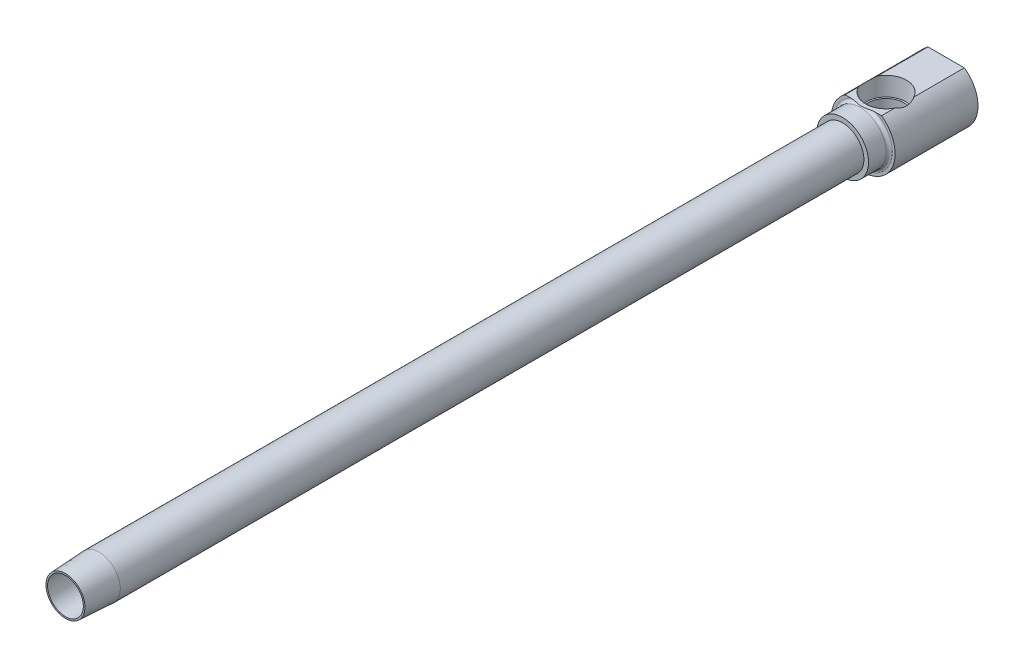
ISO-10303-21;
HEADER;
FILE_DESCRIPTION(('STEP AP214'),'2;1');
FILE_NAME('part.step','',(''),(''),'','','');
FILE_SCHEMA(('AUTOMOTIVE_DESIGN { 1 0 10303 214 1 1 1 1 }'));
ENDSEC;
DATA;
#1=APPLICATION_CONTEXT('core data for automotive mechanical design processes');
#2=APPLICATION_PROTOCOL_DEFINITION('international standard','automotive_design',2000,#1);
#3=PRODUCT_CONTEXT('',#1,'mechanical');
#4=PRODUCT('Part','Part','',(#3));
#5=PRODUCT_RELATED_PRODUCT_CATEGORY('part','',(#4));
#6=PRODUCT_DEFINITION_FORMATION('','',#4);
#7=PRODUCT_DEFINITION_CONTEXT('part definition',#1,'design');
#8=PRODUCT_DEFINITION('design','',#6,#7);
#9=PRODUCT_DEFINITION_SHAPE('','',#8);
#10=(LENGTH_UNIT() NAMED_UNIT(*) SI_UNIT(.MILLI.,.METRE.));
#11=(NAMED_UNIT(*) PLANE_ANGLE_UNIT() SI_UNIT($,.RADIAN.));
#12=(NAMED_UNIT(*) SI_UNIT($,.STERADIAN.) SOLID_ANGLE_UNIT());
#13=UNCERTAINTY_MEASURE_WITH_UNIT(LENGTH_MEASURE(1.E-05),#10,'distance_accuracy_value','');
#14=(GEOMETRIC_REPRESENTATION_CONTEXT(3) GLOBAL_UNCERTAINTY_ASSIGNED_CONTEXT((#13)) GLOBAL_UNIT_ASSIGNED_CONTEXT((#10,
#11,#12)) REPRESENTATION_CONTEXT('',''));
#15=CARTESIAN_POINT('',(0.,0.,0.));
#16=DIRECTION('',(0.,0.,1.));
#17=DIRECTION('',(1.,0.,0.));
#18=AXIS2_PLACEMENT_3D('',#15,#16,#17);
#19=CARTESIAN_POINT('',(-4.3815,0.,0.));
#20=DIRECTION('',(0.,0.,1.));
#21=DIRECTION('',(1.,0.,0.));
#22=AXIS2_PLACEMENT_3D('',#19,#20,#21);
#23=PLANE('',#22);
#24=CARTESIAN_POINT('',(0.,0.,0.));
#25=DIRECTION('',(0.,0.,-1.));
#26=DIRECTION('',(-1.,0.,0.));
#27=AXIS2_PLACEMENT_3D('',#24,#25,#26);
#28=CIRCLE('',#27,4.3815);
#29=CARTESIAN_POINT('',(-4.3815,0.,0.));
#30=VERTEX_POINT('',#29);
#31=EDGE_CURVE('E18',#30,#30,#28,.T.);
#32=ORIENTED_EDGE('',*,*,#31,.T.);
#33=EDGE_LOOP('',(#32));
#34=FACE_BOUND('',#33,.T.);
#35=CARTESIAN_POINT('',(0.,0.,0.));
#36=DIRECTION('',(0.,0.,-1.));
#37=DIRECTION('',(-1.,0.,0.));
#38=AXIS2_PLACEMENT_3D('',#35,#36,#37);
#39=CIRCLE('',#38,4.7752);
#40=CARTESIAN_POINT('',(-4.7752,0.,0.));
#41=VERTEX_POINT('',#40);
#42=EDGE_CURVE('E148',#41,#41,#39,.T.);
#43=ORIENTED_EDGE('',*,*,#42,.F.);
#44=EDGE_LOOP('',(#43));
#45=FACE_BOUND('',#44,.T.);
#46=ADVANCED_FACE('F15',(#34,#45),#23,.T.);
#47=CARTESIAN_POINT('',(0.,0.,-257.772366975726));
#48=DIRECTION('',(0.,0.,-1.));
#49=DIRECTION('',(-1.,0.,0.));
#50=AXIS2_PLACEMENT_3D('',#47,#48,#49);
#51=CYLINDRICAL_SURFACE('',#50,5.207);
#52=CARTESIAN_POINT('',(0.,0.,-8.2392348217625));
#53=DIRECTION('',(0.,0.,-1.));
#54=DIRECTION('',(-1.,0.,0.));
#55=AXIS2_PLACEMENT_3D('',#52,#53,#54);
#56=CIRCLE('',#55,5.207);
#57=CARTESIAN_POINT('',(-5.207,0.,-8.2392348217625));
#58=VERTEX_POINT('',#57);
#59=EDGE_CURVE('E150',#58,#58,#56,.T.);
#60=ORIENTED_EDGE('',*,*,#59,.T.);
#61=EDGE_LOOP('',(#60));
#62=FACE_BOUND('',#61,.T.);
#63=CARTESIAN_POINT('',(0.,0.,-190.5254));
#64=DIRECTION('',(0.,0.,-1.));
#65=DIRECTION('',(-1.,0.,0.));
#66=AXIS2_PLACEMENT_3D('',#63,#64,#65);
#67=CIRCLE('',#66,5.207);
#68=CARTESIAN_POINT('',(-5.207,0.,-190.5254));
#69=VERTEX_POINT('',#68);
#70=EDGE_CURVE('E240',#69,#69,#67,.T.);
#71=ORIENTED_EDGE('',*,*,#70,.F.);
#72=EDGE_LOOP('',(#71));
#73=FACE_BOUND('',#72,.T.);
#74=ADVANCED_FACE('F135',(#62,#73),#51,.T.);
#75=CARTESIAN_POINT('',(-4.4577,6.41348742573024,-182.5752));
#76=DIRECTION('',(0.,-1.,0.));
#77=DIRECTION('',(0.,0.,-1.));
#78=AXIS2_PLACEMENT_3D('',#75,#76,#77);
#79=PLANE('',#78);
#80=DIRECTION('',(0.,0.,-1.));
#81=VECTOR('',#80,1.);
#82=CARTESIAN_POINT('',(4.4577,6.41348742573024,-182.5752));
#83=LINE('',#82,#81);
#84=CARTESIAN_POINT('',(4.4577,6.41348742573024,-195.58));
#85=VERTEX_POINT('',#84);
#86=CARTESIAN_POINT('',(4.4577,6.41348742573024,-198.821408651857));
#87=VERTEX_POINT('',#86);
#88=EDGE_CURVE('E293',#85,#87,#83,.T.);
#89=ORIENTED_EDGE('',*,*,#88,.T.);
#90=CARTESIAN_POINT('',(0.,6.41348742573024,-201.168));
#91=DIRECTION('',(0.,-1.,0.));
#92=DIRECTION('',(0.,0.,-1.));
#93=AXIS2_PLACEMENT_3D('',#90,#91,#92);
#94=CIRCLE('',#93,5.03761652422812);
#95=CARTESIAN_POINT('',(-4.4577,6.41348742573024,-198.821408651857));
#96=VERTEX_POINT('',#95);
#97=EDGE_CURVE('E157',#87,#96,#94,.T.);
#98=ORIENTED_EDGE('',*,*,#97,.T.);
#99=DIRECTION('',(0.,0.,-1.));
#100=VECTOR('',#99,1.);
#101=CARTESIAN_POINT('',(-4.4577,6.41348742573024,-182.5752));
#102=LINE('',#101,#100);
#103=CARTESIAN_POINT('',(-4.4577,6.41348742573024,-195.58));
#104=VERTEX_POINT('',#103);
#105=EDGE_CURVE('E291',#104,#96,#102,.T.);
#106=ORIENTED_EDGE('',*,*,#105,.F.);
#107=DIRECTION('',(1.,0.,0.));
#108=VECTOR('',#107,1.);
#109=CARTESIAN_POINT('',(-7.112,6.41348742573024,-195.58));
#110=LINE('',#109,#108);
#111=CARTESIAN_POINT('',(-3.07371485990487,6.41348742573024,-195.58));
#112=VERTEX_POINT('',#111);
#113=EDGE_CURVE('E282',#104,#112,#110,.T.);
#114=ORIENTED_EDGE('',*,*,#113,.T.);
#115=CARTESIAN_POINT('',(0.,6.41348742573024,-195.122506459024));
#116=CARTESIAN_POINT('',(0.0547669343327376,6.41348742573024,-195.122502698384));
#117=CARTESIAN_POINT('',(0.109530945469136,6.41348742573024,-195.124131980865));
#118=CARTESIAN_POINT('',(0.218888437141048,6.41348742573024,-195.130434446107));
#119=CARTESIAN_POINT('',(0.273481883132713,6.41348742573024,-195.13510820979));
#120=CARTESIAN_POINT('',(0.437133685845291,6.41348742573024,-195.152954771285));
#121=CARTESIAN_POINT('',(0.545759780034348,6.41348742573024,-195.169948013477));
#122=CARTESIAN_POINT('',(0.763468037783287,6.41348742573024,-195.209460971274));
#123=CARTESIAN_POINT('',(0.872535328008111,6.41348742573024,-195.232054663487));
#124=CARTESIAN_POINT('',(1.09015205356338,6.41348742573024,-195.279005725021));
#125=CARTESIAN_POINT('',(1.19870193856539,6.41348742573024,-195.30336104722));
#126=CARTESIAN_POINT('',(1.441224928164,6.41348742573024,-195.357231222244));
#127=CARTESIAN_POINT('',(1.57522547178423,6.41348742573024,-195.386625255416));
#128=CARTESIAN_POINT('',(1.84407607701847,6.41348742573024,-195.441759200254));
#129=CARTESIAN_POINT('',(1.97892653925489,6.41348742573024,-195.467497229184));
#130=CARTESIAN_POINT('',(2.24890278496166,6.41348742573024,-195.512646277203));
#131=CARTESIAN_POINT('',(2.38402236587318,6.41348742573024,-195.532093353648));
#132=CARTESIAN_POINT('',(2.6552179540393,6.41348742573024,-195.562201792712));
#133=CARTESIAN_POINT('',(2.79129309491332,6.41348742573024,-195.572870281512));
#134=CARTESIAN_POINT('',(2.99640645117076,6.41348742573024,-195.579807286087));
#135=CARTESIAN_POINT('',(3.06529255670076,6.41348742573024,-195.580589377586));
#136=CARTESIAN_POINT('',(3.20300193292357,6.41348742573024,-195.578500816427));
#137=CARTESIAN_POINT('',(3.27182521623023,6.41348742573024,-195.575631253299));
#138=CARTESIAN_POINT('',(3.40907712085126,6.41348742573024,-195.565580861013));
#139=CARTESIAN_POINT('',(3.47750615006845,6.41348742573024,-195.558405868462));
#140=CARTESIAN_POINT('',(3.61360674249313,6.41348742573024,-195.538913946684));
#141=CARTESIAN_POINT('',(3.68127881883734,6.41348742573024,-195.526600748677));
#142=CARTESIAN_POINT('',(3.81134745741,6.41348742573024,-195.496638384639));
#143=CARTESIAN_POINT('',(3.87382282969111,6.41348742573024,-195.479338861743));
#144=CARTESIAN_POINT('',(3.99661419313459,6.41348742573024,-195.437990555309));
#145=CARTESIAN_POINT('',(4.05692926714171,6.41348742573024,-195.413938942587));
#146=CARTESIAN_POINT('',(4.16438836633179,6.41348742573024,-195.361987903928));
#147=CARTESIAN_POINT('',(4.21210790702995,6.41348742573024,-195.335296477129));
#148=CARTESIAN_POINT('',(4.30289303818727,6.41348742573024,-195.274877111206));
#149=CARTESIAN_POINT('',(4.34597104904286,6.41348742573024,-195.241168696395));
#150=CARTESIAN_POINT('',(4.40881816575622,6.41348742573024,-195.180664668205));
#151=CARTESIAN_POINT('',(4.43105110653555,6.41348742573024,-195.156438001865));
#152=CARTESIAN_POINT('',(4.47168650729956,6.41348742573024,-195.104939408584));
#153=CARTESIAN_POINT('',(4.49009362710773,6.41348742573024,-195.077671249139));
#154=CARTESIAN_POINT('',(4.51921410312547,6.41348742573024,-195.02504266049));
#155=CARTESIAN_POINT('',(4.53069614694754,6.41348742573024,-195.000111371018));
#156=CARTESIAN_POINT('',(4.54935954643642,6.41348742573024,-194.94867800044));
#157=CARTESIAN_POINT('',(4.55654415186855,6.41348742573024,-194.922177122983));
#158=CARTESIAN_POINT('',(4.56604079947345,6.41348742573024,-194.868144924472));
#159=CARTESIAN_POINT('',(4.56832514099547,6.41348742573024,-194.840608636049));
#160=CARTESIAN_POINT('',(4.56771494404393,6.41348742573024,-194.785594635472));
#161=CARTESIAN_POINT('',(4.56482077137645,6.41348742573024,-194.758116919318));
#162=CARTESIAN_POINT('',(4.55461750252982,6.41348742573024,-194.706573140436));
#163=CARTESIAN_POINT('',(4.54772671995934,6.41348742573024,-194.682421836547));
#164=CARTESIAN_POINT('',(4.53037439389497,6.41348742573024,-194.635451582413));
#165=CARTESIAN_POINT('',(4.51991160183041,6.41348742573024,-194.612633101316));
#166=CARTESIAN_POINT('',(4.49089034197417,6.41348742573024,-194.559253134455));
#167=CARTESIAN_POINT('',(4.47078194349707,6.41348742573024,-194.529535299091));
#168=CARTESIAN_POINT('',(4.42607813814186,6.41348742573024,-194.473694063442));
#169=CARTESIAN_POINT('',(4.40147230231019,6.41348742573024,-194.4475792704));
#170=CARTESIAN_POINT('',(4.33512083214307,6.41348742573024,-194.385846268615));
#171=CARTESIAN_POINT('',(4.29121960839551,6.41348742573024,-194.352560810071));
#172=CARTESIAN_POINT('',(4.19894894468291,6.41348742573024,-194.292992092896));
#173=CARTESIAN_POINT('',(4.15057028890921,6.41348742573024,-194.266723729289));
#174=CARTESIAN_POINT('',(4.05679374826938,6.41348742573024,-194.222729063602));
#175=CARTESIAN_POINT('',(4.0116866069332,6.41348742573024,-194.204369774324));
#176=CARTESIAN_POINT('',(3.92005010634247,6.41348742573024,-194.171582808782));
#177=CARTESIAN_POINT('',(3.87351963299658,6.41348742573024,-194.157158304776));
#178=CARTESIAN_POINT('',(3.73245646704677,6.41348742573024,-194.118915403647));
#179=CARTESIAN_POINT('',(3.63654836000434,6.41348742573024,-194.1001691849));
#180=CARTESIAN_POINT('',(3.441107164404,6.41348742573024,-194.072600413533));
#181=CARTESIAN_POINT('',(3.34154251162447,6.41348742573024,-194.064028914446));
#182=CARTESIAN_POINT('',(3.14195452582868,6.41348742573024,-194.055217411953));
#183=CARTESIAN_POINT('',(3.04193075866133,6.41348742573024,-194.054988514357));
#184=CARTESIAN_POINT('',(2.84160218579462,6.41348742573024,-194.061135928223));
#185=CARTESIAN_POINT('',(2.74129862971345,6.41348742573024,-194.06754664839));
#186=CARTESIAN_POINT('',(2.54132534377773,6.41348742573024,-194.085618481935));
#187=CARTESIAN_POINT('',(2.4416549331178,6.41348742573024,-194.097272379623));
#188=CARTESIAN_POINT('',(2.13711894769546,6.41348742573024,-194.139263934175));
#189=CARTESIAN_POINT('',(1.93319771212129,6.41348742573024,-194.17628574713));
#190=CARTESIAN_POINT('',(1.62827949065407,6.41348742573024,-194.238357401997));
#191=CARTESIAN_POINT('',(1.52655364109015,6.41348742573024,-194.260199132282));
#192=CARTESIAN_POINT('',(1.32330984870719,6.41348742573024,-194.30483124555));
#193=CARTESIAN_POINT('',(1.22179189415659,6.41348742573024,-194.327621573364));
#194=CARTESIAN_POINT('',(1.02058637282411,6.41348742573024,-194.37212134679));
#195=CARTESIAN_POINT('',(0.920901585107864,6.41348742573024,-194.39384319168));
#196=CARTESIAN_POINT('',(0.720902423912,6.41348742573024,-194.43448684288));
#197=CARTESIAN_POINT('',(0.620587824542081,6.41348742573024,-194.453407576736));
#198=CARTESIAN_POINT('',(0.419827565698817,6.41348742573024,-194.484865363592));
#199=CARTESIAN_POINT('',(0.319392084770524,6.41348742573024,-194.497460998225));
#200=CARTESIAN_POINT('',(0.168224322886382,6.41348742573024,-194.508901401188));
#201=CARTESIAN_POINT('',(0.117779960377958,6.41348742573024,-194.511473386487));
#202=CARTESIAN_POINT('',(0.0168277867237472,6.41348742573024,-194.51389611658));
#203=CARTESIAN_POINT('',(-0.0336800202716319,6.41348742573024,-194.513747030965));
#204=CARTESIAN_POINT('',(-0.167203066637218,6.41348742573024,-194.509734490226));
#205=CARTESIAN_POINT('',(-0.250151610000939,6.41348742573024,-194.503534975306));
#206=CARTESIAN_POINT('',(-0.415406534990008,6.41348742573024,-194.485308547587));
#207=CARTESIAN_POINT('',(-0.497712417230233,6.41348742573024,-194.473277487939));
#208=CARTESIAN_POINT('',(-0.662364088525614,6.41348742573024,-194.445484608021));
#209=CARTESIAN_POINT('',(-0.744704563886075,6.41348742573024,-194.429692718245));
#210=CARTESIAN_POINT('',(-0.908954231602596,6.41348742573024,-194.396225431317));
#211=CARTESIAN_POINT('',(-0.990863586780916,6.41348742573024,-194.378550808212));
#212=CARTESIAN_POINT('',(-1.15599570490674,6.41348742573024,-194.3422569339));
#213=CARTESIAN_POINT('',(-1.23921597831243,6.41348742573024,-194.323626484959));
#214=CARTESIAN_POINT('',(-1.4057208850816,6.41348742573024,-194.286671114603));
#215=CARTESIAN_POINT('',(-1.48900551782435,6.41348742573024,-194.26834619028));
#216=CARTESIAN_POINT('',(-1.7386665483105,6.41348742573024,-194.215071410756));
#217=CARTESIAN_POINT('',(-1.90540243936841,6.41348742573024,-194.18168897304));
#218=CARTESIAN_POINT('',(-2.16681921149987,6.41348742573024,-194.136734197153));
#219=CARTESIAN_POINT('',(-2.26095047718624,6.41348742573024,-194.122025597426));
#220=CARTESIAN_POINT('',(-2.44971550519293,6.41348742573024,-194.096348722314));
#221=CARTESIAN_POINT('',(-2.5443491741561,6.41348742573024,-194.085379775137));
#222=CARTESIAN_POINT('',(-2.73368335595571,6.41348742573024,-194.068201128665));
#223=CARTESIAN_POINT('',(-2.82838206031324,6.41348742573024,-194.061972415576));
#224=CARTESIAN_POINT('',(-3.01793602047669,6.41348742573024,-194.055372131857));
#225=CARTESIAN_POINT('',(-3.11279113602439,6.41348742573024,-194.054996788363));
#226=CARTESIAN_POINT('',(-3.31218734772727,6.41348742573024,-194.061898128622));
#227=CARTESIAN_POINT('',(-3.41671052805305,6.41348742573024,-194.06997414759));
#228=CARTESIAN_POINT('',(-3.57234667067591,6.41348742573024,-194.090810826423));
#229=CARTESIAN_POINT('',(-3.62404703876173,6.41348742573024,-194.099213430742));
#230=CARTESIAN_POINT('',(-3.72677708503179,6.41348742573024,-194.119392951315));
#231=CARTESIAN_POINT('',(-3.77780699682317,6.41348742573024,-194.131168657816));
#232=CARTESIAN_POINT('',(-3.89634421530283,6.41348742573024,-194.163403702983));
#233=CARTESIAN_POINT('',(-3.96343170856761,6.41348742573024,-194.185458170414));
#234=CARTESIAN_POINT('',(-4.09405850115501,6.41348742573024,-194.238413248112));
#235=CARTESIAN_POINT('',(-4.1576046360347,6.41348742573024,-194.269296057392));
#236=CARTESIAN_POINT('',(-4.25441976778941,6.41348742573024,-194.327888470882));
#237=CARTESIAN_POINT('',(-4.28979385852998,6.41348742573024,-194.3520976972));
#238=CARTESIAN_POINT('',(-4.35685699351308,6.41348742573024,-194.405223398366));
#239=CARTESIAN_POINT('',(-4.38855051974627,6.41348742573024,-194.43413404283));
#240=CARTESIAN_POINT('',(-4.4393789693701,6.41348742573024,-194.489413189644));
#241=CARTESIAN_POINT('',(-4.45969325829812,6.41348742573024,-194.51468864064));
#242=CARTESIAN_POINT('',(-4.49606293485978,6.41348742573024,-194.56815327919));
#243=CARTESIAN_POINT('',(-4.51212457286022,6.41348742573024,-194.596338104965));
#244=CARTESIAN_POINT('',(-4.53626721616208,6.41348742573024,-194.649729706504));
#245=CARTESIAN_POINT('',(-4.54527744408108,6.41348742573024,-194.674513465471));
#246=CARTESIAN_POINT('',(-4.5590260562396,6.41348742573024,-194.725243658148));
#247=CARTESIAN_POINT('',(-4.56376753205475,6.41348742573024,-194.751189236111));
#248=CARTESIAN_POINT('',(-4.56859445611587,6.41348742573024,-194.803605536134));
#249=CARTESIAN_POINT('',(-4.56866422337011,6.41348742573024,-194.830077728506));
#250=CARTESIAN_POINT('',(-4.56410153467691,6.41348742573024,-194.882612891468));
#251=CARTESIAN_POINT('',(-4.55946793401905,6.41348742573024,-194.908675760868));
#252=CARTESIAN_POINT('',(-4.54620785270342,6.41348742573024,-194.958450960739));
#253=CARTESIAN_POINT('',(-4.53777611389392,6.41348742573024,-194.98221625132));
#254=CARTESIAN_POINT('',(-4.51754524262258,6.41348742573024,-195.028251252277));
#255=CARTESIAN_POINT('',(-4.50574488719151,6.41348742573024,-195.050520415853));
#256=CARTESIAN_POINT('',(-4.47265204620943,6.41348742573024,-195.104236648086));
#257=CARTESIAN_POINT('',(-4.44958451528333,6.41348742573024,-195.134590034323));
#258=CARTESIAN_POINT('',(-4.39893449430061,6.41348742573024,-195.191262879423));
#259=CARTESIAN_POINT('',(-4.37134039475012,6.41348742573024,-195.217571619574));
#260=CARTESIAN_POINT('',(-4.29637766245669,6.41348742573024,-195.280336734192));
#261=CARTESIAN_POINT('',(-4.24670632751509,6.41348742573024,-195.314023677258));
#262=CARTESIAN_POINT('',(-4.1429475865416,6.41348742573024,-195.373603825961));
#263=CARTESIAN_POINT('',(-4.08885088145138,6.41348742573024,-195.3994800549));
#264=CARTESIAN_POINT('',(-3.98330416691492,6.41348742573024,-195.44266584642));
#265=CARTESIAN_POINT('',(-3.93208515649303,6.41348742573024,-195.460552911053));
#266=CARTESIAN_POINT('',(-3.82828626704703,6.41348742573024,-195.491892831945));
#267=CARTESIAN_POINT('',(-3.77570527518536,6.41348742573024,-195.505341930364));
#268=CARTESIAN_POINT('',(-3.66966451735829,6.41348742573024,-195.528467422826));
#269=CARTESIAN_POINT('',(-3.61620370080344,6.41348742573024,-195.538138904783));
#270=CARTESIAN_POINT('',(-3.50882362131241,6.41348742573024,-195.554213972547));
#271=CARTESIAN_POINT('',(-3.45490452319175,6.41348742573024,-195.560618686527));
#272=CARTESIAN_POINT('',(-3.32893010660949,6.41348742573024,-195.572254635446));
#273=CARTESIAN_POINT('',(-3.25677506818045,6.41348742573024,-195.576396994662));
#274=CARTESIAN_POINT('',(-3.11233636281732,6.41348742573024,-195.580499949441));
#275=CARTESIAN_POINT('',(-3.04005265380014,6.41348742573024,-195.580458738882));
#276=CARTESIAN_POINT('',(-2.82311145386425,6.41348742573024,-195.575065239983));
#277=CARTESIAN_POINT('',(-2.6785850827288,6.41348742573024,-195.564427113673));
#278=CARTESIAN_POINT('',(-2.38941343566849,6.41348742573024,-195.533026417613));
#279=CARTESIAN_POINT('',(-2.24477928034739,6.41348742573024,-195.512171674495));
#280=CARTESIAN_POINT('',(-1.95690250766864,6.41348742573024,-195.463578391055));
#281=CARTESIAN_POINT('',(-1.81365833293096,6.41348742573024,-195.435848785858));
#282=CARTESIAN_POINT('',(-1.53108031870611,6.41348742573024,-195.377154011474));
#283=CARTESIAN_POINT('',(-1.39172865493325,6.41348742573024,-195.34627129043));
#284=CARTESIAN_POINT('',(-1.18259583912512,6.41348742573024,-195.299745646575));
#285=CARTESIAN_POINT('',(-1.11279428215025,6.41348742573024,-195.284187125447));
#286=CARTESIAN_POINT('',(-0.973069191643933,6.41348742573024,-195.253631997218));
#287=CARTESIAN_POINT('',(-0.903145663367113,6.41348742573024,-195.238635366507));
#288=CARTESIAN_POINT('',(-0.764296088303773,6.41348742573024,-195.210259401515));
#289=CARTESIAN_POINT('',(-0.69537516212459,6.41348742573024,-195.196855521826));
#290=CARTESIAN_POINT('',(-0.557105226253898,6.41348742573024,-195.172372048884));
#291=CARTESIAN_POINT('',(-0.487756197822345,6.41348742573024,-195.161292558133));
#292=CARTESIAN_POINT('',(-0.348841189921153,6.41348742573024,-195.142764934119));
#293=CARTESIAN_POINT('',(-0.279277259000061,6.41348742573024,-195.135302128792));
#294=CARTESIAN_POINT('',(-0.139807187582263,6.41348742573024,-195.125176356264));
#295=CARTESIAN_POINT('',(-0.069901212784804,6.41348742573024,-195.122511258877));
#296=CARTESIAN_POINT('',(0.,6.41348742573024,-195.122506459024));
#297=B_SPLINE_CURVE_WITH_KNOTS('',3,(#115,#116,#117,#118,#119,#120,#121,#122,#123,#124,#125,
#126,#127,#128,#129,#130,#131,#132,#133,#134,#135,#136,#137,#138,#139,#140,#141,#142,#143,#144,
#145,#146,#147,#148,#149,#150,#151,#152,#153,#154,#155,#156,#157,#158,#159,#160,#161,#162,#163,
#164,#165,#166,#167,#168,#169,#170,#171,#172,#173,#174,#175,#176,#177,#178,#179,#180,#181,#182,
#183,#184,#185,#186,#187,#188,#189,#190,#191,#192,#193,#194,#195,#196,#197,#198,#199,#200,#201,
#202,#203,#204,#205,#206,#207,#208,#209,#210,#211,#212,#213,#214,#215,#216,#217,#218,#219,#220,
#221,#222,#223,#224,#225,#226,#227,#228,#229,#230,#231,#232,#233,#234,#235,#236,#237,#238,#239,
#240,#241,#242,#243,#244,#245,#246,#247,#248,#249,#250,#251,#252,#253,#254,#255,#256,#257,#258,
#259,#260,#261,#262,#263,#264,#265,#266,#267,#268,#269,#270,#271,#272,#273,#274,#275,#276,#277,
#278,#279,#280,#281,#282,#283,#284,#285,#286,#287,#288,#289,#290,#291,#292,#293,#294,#295,#296),
.UNSPECIFIED.,.T.,.F.,(4,2,2,2,2,2,2,2,2,2,2,2,2,2,2,2,2,2,2,2,2,2,2,2,2,2,2,2,2,2,2,2,2,2,2,2,
2,2,2,2,2,2,2,2,2,2,2,2,2,2,2,2,2,2,2,2,2,2,2,2,2,2,2,2,2,2,2,2,2,2,2,2,2,2,2,2,2,2,2,2,2,2,2,2,
2,2,2,2,2,2,4),(0.,0.164273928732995,0.328579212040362,0.658096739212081,0.992223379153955,
1.32596779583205,1.73751584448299,2.14927506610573,2.55863060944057,2.96765352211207,
3.17424892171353,3.38078269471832,3.58703711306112,3.79314201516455,3.98733137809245,
4.18160222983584,4.34518473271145,4.50831802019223,4.60668262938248,4.7049267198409,
4.78693922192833,4.86888962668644,4.95130208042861,5.03370871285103,5.10874003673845,
5.1837976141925,5.290837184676,5.39812818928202,5.5624830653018,5.72718409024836,
5.87307196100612,6.01907710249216,6.31139884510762,6.6107926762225,6.91058505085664,
7.21193886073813,7.51287920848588,8.13412004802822,8.44626765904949,8.75839714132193,
9.06445930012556,9.37063833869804,9.67392675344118,9.82538795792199,9.97683972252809,
10.2260774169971,10.4754926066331,10.7269732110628,10.9783508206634,11.2341897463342,
11.4900262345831,11.9999950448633,12.2857569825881,12.5714675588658,12.8560259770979,
13.1404009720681,13.4543312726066,13.6113768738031,13.7683662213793,13.9797728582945,
14.1907561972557,14.3190471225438,14.4471801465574,14.5441362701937,14.6409490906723,
14.7197308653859,14.7984555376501,14.8774444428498,14.9564525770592,15.0318037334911,
15.1071822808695,15.2209045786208,15.3349232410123,15.5139662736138,15.6933957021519,
15.8559161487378,16.0185738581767,16.1814423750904,16.344254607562,16.5609200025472,
16.7776789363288,17.2118589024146,17.6500302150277,18.0876350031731,18.5158248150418,
18.7303690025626,18.9449041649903,19.1555191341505,19.3661433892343,19.5759058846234,
19.7855752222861),.UNSPECIFIED.);
#298=CARTESIAN_POINT('',(3.07371485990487,6.41348742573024,-195.58));
#299=VERTEX_POINT('',#298);
#300=EDGE_CURVE('E232',#112,#299,#297,.T.);
#301=ORIENTED_EDGE('',*,*,#300,.T.);
#302=EDGE_CURVE('E297',#299,#85,#110,.T.);
#303=ORIENTED_EDGE('',*,*,#302,.T.);
#304=EDGE_LOOP('',(#89,#98,#106,#114,#301,#303));
#305=FACE_BOUND('',#304,.T.);
#306=ADVANCED_FACE('F141',(#305),#79,.F.);
#307=CARTESIAN_POINT('',(0.,0.,-257.772366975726));
#308=DIRECTION('',(0.,0.,-1.));
#309=DIRECTION('',(-1.,0.,0.));
#310=AXIS2_PLACEMENT_3D('',#307,#308,#309);
#311=CYLINDRICAL_SURFACE('',#310,4.3815);
#312=ORIENTED_EDGE('',*,*,#31,.F.);
#313=EDGE_LOOP('',(#312));
#314=FACE_BOUND('',#313,.T.);
#315=CARTESIAN_POINT('',(0.,0.,-190.5254));
#316=DIRECTION('',(0.,0.,-1.));
#317=DIRECTION('',(-1.,0.,0.));
#318=AXIS2_PLACEMENT_3D('',#315,#316,#317);
#319=CIRCLE('',#318,4.3815);
#320=CARTESIAN_POINT('',(-3.16538744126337,-3.02949906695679,-190.5254));
#321=VERTEX_POINT('',#320);
#322=CARTESIAN_POINT('',(3.16538744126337,-3.02949906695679,-190.5254));
#323=VERTEX_POINT('',#322);
#324=EDGE_CURVE('E235',#321,#323,#319,.T.);
#325=ORIENTED_EDGE('',*,*,#324,.T.);
#326=CARTESIAN_POINT('',(3.16547479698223,-3.02940779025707,-190.5256));
#327=CARTESIAN_POINT('',(3.14342446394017,-3.05243943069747,-190.475077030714));
#328=CARTESIAN_POINT('',(3.11972293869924,-3.07670954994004,-190.425848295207));
#329=CARTESIAN_POINT('',(3.0688820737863,-3.12742914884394,-190.330394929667));
#330=CARTESIAN_POINT('',(3.04174325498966,-3.1538782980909,-190.284169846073));
#331=CARTESIAN_POINT('',(2.95559153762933,-3.23545829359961,-190.151577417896));
#332=CARTESIAN_POINT('',(2.89136505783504,-3.29334010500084,-190.070167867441));
#333=CARTESIAN_POINT('',(2.75011359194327,-3.41217163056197,-189.922271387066));
#334=CARTESIAN_POINT('',(2.67308610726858,-3.47312194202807,-189.85578737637));
#335=CARTESIAN_POINT('',(2.50819184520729,-3.59402230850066,-189.73634210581));
#336=CARTESIAN_POINT('',(2.42029620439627,-3.653969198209,-189.683418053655));
#337=CARTESIAN_POINT('',(2.25775713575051,-3.75593106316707,-189.600236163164));
#338=CARTESIAN_POINT('',(2.18486784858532,-3.79884421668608,-189.567575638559));
#339=CARTESIAN_POINT('',(2.03488862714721,-3.88124850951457,-189.507990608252));
#340=CARTESIAN_POINT('',(1.95779677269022,-3.92073806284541,-189.481068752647));
#341=CARTESIAN_POINT('',(1.80004579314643,-3.99562399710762,-189.432117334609));
#342=CARTESIAN_POINT('',(1.71938265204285,-4.03101559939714,-189.410093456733));
#343=CARTESIAN_POINT('',(1.555150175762,-4.0971824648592,-189.370304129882));
#344=CARTESIAN_POINT('',(1.47157967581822,-4.12795585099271,-189.352540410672));
#345=CARTESIAN_POINT('',(1.21289030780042,-4.21425858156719,-189.304005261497));
#346=CARTESIAN_POINT('',(1.03389313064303,-4.26180132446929,-189.279192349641));
#347=CARTESIAN_POINT('',(0.670227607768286,-4.33390350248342,-189.242389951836));
#348=CARTESIAN_POINT('',(0.485562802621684,-4.35847699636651,-189.230392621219));
#349=CARTESIAN_POINT('',(0.191999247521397,-4.37863265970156,-189.220580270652));
#350=CARTESIAN_POINT('',(0.0836976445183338,-4.38203983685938,-189.21893316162));
#351=CARTESIAN_POINT('',(-0.132842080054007,-4.38082235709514,-189.219520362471));
#352=CARTESIAN_POINT('',(-0.241080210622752,-4.37619962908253,-189.221753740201));
#353=CARTESIAN_POINT('',(-0.456961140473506,-4.35895390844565,-189.230180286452));
#354=CARTESIAN_POINT('',(-0.564602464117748,-4.34631610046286,-189.236380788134));
#355=CARTESIAN_POINT('',(-0.778298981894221,-4.31317491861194,-189.25296127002));
#356=CARTESIAN_POINT('',(-0.8843548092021,-4.29267477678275,-189.263339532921));
#357=CARTESIAN_POINT('',(-1.09632494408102,-4.24354696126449,-189.288913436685));
#358=CARTESIAN_POINT('',(-1.20219105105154,-4.21476010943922,-189.304204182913));
#359=CARTESIAN_POINT('',(-1.41060084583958,-4.14965783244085,-189.340134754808));
#360=CARTESIAN_POINT('',(-1.51314609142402,-4.11334599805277,-189.360772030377));
#361=CARTESIAN_POINT('',(-1.7139045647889,-4.03381995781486,-189.408258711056));
#362=CARTESIAN_POINT('',(-1.81212318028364,-3.99061466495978,-189.435100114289));
#363=CARTESIAN_POINT('',(-2.00320334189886,-3.8982035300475,-189.496192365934));
#364=CARTESIAN_POINT('',(-2.09606839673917,-3.84900168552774,-189.530438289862));
#365=CARTESIAN_POINT('',(-2.29534319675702,-3.73428068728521,-189.616661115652));
#366=CARTESIAN_POINT('',(-2.40014619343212,-3.66757137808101,-189.670889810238));
#367=CARTESIAN_POINT('',(-2.54748315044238,-3.56531535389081,-189.764688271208));
#368=CARTESIAN_POINT('',(-2.5948845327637,-3.53092006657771,-189.79796870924));
#369=CARTESIAN_POINT('',(-2.68608105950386,-3.46204578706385,-189.869051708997));
#370=CARTESIAN_POINT('',(-2.72987823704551,-3.42756685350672,-189.906851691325));
#371=CARTESIAN_POINT('',(-2.81247040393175,-3.36010888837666,-189.986220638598));
#372=CARTESIAN_POINT('',(-2.85136068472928,-3.32711374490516,-190.027676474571));
#373=CARTESIAN_POINT('',(-2.92505072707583,-3.26251751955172,-190.115085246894));
#374=CARTESIAN_POINT('',(-2.95985031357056,-3.23091649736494,-190.161038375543));
#375=CARTESIAN_POINT('',(-3.02566242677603,-3.16938090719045,-190.257865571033));
#376=CARTESIAN_POINT('',(-3.05661307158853,-3.13947696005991,-190.308801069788));
#377=CARTESIAN_POINT('',(-3.11423662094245,-3.08232206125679,-190.414485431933));
#378=CARTESIAN_POINT('',(-3.1409073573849,-3.05507245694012,-190.469236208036));
#379=CARTESIAN_POINT('',(-3.16547479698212,-3.02940779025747,-190.5256));
#380=B_SPLINE_CURVE_WITH_KNOTS('',3,(#326,#327,#328,#329,#330,#331,#332,#333,#334,#335,#336,
#337,#338,#339,#340,#341,#342,#343,#344,#345,#346,#347,#348,#349,#350,#351,#352,#353,#354,#355,
#356,#357,#358,#359,#360,#361,#362,#363,#364,#365,#366,#367,#368,#369,#370,#371,#372,#373,#374,
#375,#376,#377,#378,#379),.UNSPECIFIED.,.F.,.F.,(4,2,2,2,2,2,2,2,2,2,2,2,2,2,2,2,2,2,2,2,2,2,2,
2,2,2,4),(0.,0.179155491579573,0.358283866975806,0.712611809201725,1.06700899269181,
1.42236845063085,1.69403668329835,1.96583010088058,2.23793733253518,2.51015486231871,
3.0685602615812,3.62662365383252,3.95140246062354,4.27610326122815,4.6014060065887,
4.92657516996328,5.25846293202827,5.59019268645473,5.92149695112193,6.25258155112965,
6.6576063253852,6.85948934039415,7.06125768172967,7.25815107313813,7.45505288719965,
7.65479552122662,7.85463902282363),.UNSPECIFIED.);
#381=EDGE_CURVE('E203',#323,#321,#380,.T.);
#382=ORIENTED_EDGE('',*,*,#381,.T.);
#383=EDGE_LOOP('',(#325,#382));
#384=FACE_BOUND('',#383,.T.);
#385=ADVANCED_FACE('F234',(#314,#384),#311,.F.);
#386=CARTESIAN_POINT('',(-4.3815,0.,-190.5254));
#387=DIRECTION('',(0.,0.,1.));
#388=DIRECTION('',(1.,0.,0.));
#389=AXIS2_PLACEMENT_3D('',#386,#387,#388);
#390=PLANE('',#389);
#391=ORIENTED_EDGE('',*,*,#324,.F.);
#392=CARTESIAN_POINT('',(0.,-0.364745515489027,-190.5254));
#393=DIRECTION('',(0.,0.,1.));
#394=DIRECTION('',(0.,1.,0.));
#395=AXIS2_PLACEMENT_3D('',#392,#393,#394);
#396=ELLIPSE('',#395,4.20023414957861,4.09504169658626);
#397=EDGE_CURVE('E195',#321,#323,#396,.F.);
#398=ORIENTED_EDGE('',*,*,#397,.T.);
#399=EDGE_LOOP('',(#391,#398));
#400=FACE_BOUND('',#399,.T.);
#401=ADVANCED_FACE('F237',(#400),#390,.T.);
#402=CARTESIAN_POINT('',(-5.207,0.,-190.5254));
#403=DIRECTION('',(0.,0.,1.));
#404=DIRECTION('',(1.,0.,0.));
#405=AXIS2_PLACEMENT_3D('',#402,#403,#404);
#406=PLANE('',#405);
#407=ORIENTED_EDGE('',*,*,#70,.T.);
#408=EDGE_LOOP('',(#407));
#409=FACE_BOUND('',#408,.T.);
#410=CARTESIAN_POINT('',(0.,0.,-190.5254));
#411=DIRECTION('',(0.,0.,-1.));
#412=DIRECTION('',(-1.,0.,0.));
#413=AXIS2_PLACEMENT_3D('',#410,#411,#412);
#414=CIRCLE('',#413,6.35);
#415=CARTESIAN_POINT('',(-6.35,0.,-190.5254));
#416=VERTEX_POINT('',#415);
#417=EDGE_CURVE('E273',#416,#416,#414,.T.);
#418=ORIENTED_EDGE('',*,*,#417,.F.);
#419=EDGE_LOOP('',(#418));
#420=FACE_BOUND('',#419,.T.);
#421=ADVANCED_FACE('F382',(#409,#420),#406,.T.);
#422=CARTESIAN_POINT('',(-7.8105,0.,-215.9));
#423=DIRECTION('',(0.,0.,-1.));
#424=DIRECTION('',(-1.,0.,0.));
#425=AXIS2_PLACEMENT_3D('',#422,#423,#424);
#426=PLANE('',#425);
#427=DIRECTION('',(1.,0.,0.));
#428=VECTOR('',#427,1.);
#429=CARTESIAN_POINT('',(-2.29502505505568,3.9751,-215.9));
#430=LINE('',#429,#428);
#431=CARTESIAN_POINT('',(-2.29502505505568,3.9751,-215.9));
#432=VERTEX_POINT('',#431);
#433=CARTESIAN_POINT('',(2.29502505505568,3.9751,-215.9));
#434=VERTEX_POINT('',#433);
#435=EDGE_CURVE('E236',#432,#434,#430,.T.);
#436=ORIENTED_EDGE('',*,*,#435,.F.);
#437=DIRECTION('',(0.5,0.866025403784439,0.));
#438=VECTOR('',#437,1.);
#439=CARTESIAN_POINT('',(-4.59005011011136,0.,-215.9));
#440=LINE('',#439,#438);
#441=CARTESIAN_POINT('',(-4.59005011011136,0.,-215.9));
#442=VERTEX_POINT('',#441);
#443=EDGE_CURVE('E323',#442,#432,#440,.T.);
#444=ORIENTED_EDGE('',*,*,#443,.F.);
#445=DIRECTION('',(-0.5,0.866025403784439,0.));
#446=VECTOR('',#445,1.);
#447=CARTESIAN_POINT('',(-2.29502505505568,-3.9751,-215.9));
#448=LINE('',#447,#446);
#449=CARTESIAN_POINT('',(-2.29502505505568,-3.9751,-215.9));
#450=VERTEX_POINT('',#449);
#451=EDGE_CURVE('E327',#450,#442,#448,.T.);
#452=ORIENTED_EDGE('',*,*,#451,.F.);
#453=DIRECTION('',(-1.,0.,0.));
#454=VECTOR('',#453,1.);
#455=CARTESIAN_POINT('',(2.29502505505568,-3.9751,-215.9));
#456=LINE('',#455,#454);
#457=CARTESIAN_POINT('',(2.29502505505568,-3.9751,-215.9));
#458=VERTEX_POINT('',#457);
#459=EDGE_CURVE('E330',#458,#450,#456,.T.);
#460=ORIENTED_EDGE('',*,*,#459,.F.);
#461=DIRECTION('',(-0.5,-0.866025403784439,0.));
#462=VECTOR('',#461,1.);
#463=CARTESIAN_POINT('',(4.59005011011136,0.,-215.9));
#464=LINE('',#463,#462);
#465=CARTESIAN_POINT('',(4.59005011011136,0.,-215.9));
#466=VERTEX_POINT('',#465);
#467=EDGE_CURVE('E333',#466,#458,#464,.T.);
#468=ORIENTED_EDGE('',*,*,#467,.F.);
#469=DIRECTION('',(0.5,-0.866025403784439,0.));
#470=VECTOR('',#469,1.);
#471=CARTESIAN_POINT('',(2.29502505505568,3.9751,-215.9));
#472=LINE('',#471,#470);
#473=EDGE_CURVE('E336',#434,#466,#472,.T.);
#474=ORIENTED_EDGE('',*,*,#473,.F.);
#475=EDGE_LOOP('',(#436,#444,#452,#460,#468,#474));
#476=FACE_BOUND('',#475,.T.);
#477=DIRECTION('',(-1.,0.,0.));
#478=VECTOR('',#477,1.);
#479=CARTESIAN_POINT('',(-4.4577,6.41348742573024,-215.9));
#480=LINE('',#479,#478);
#481=CARTESIAN_POINT('',(4.4577,6.41348742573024,-215.9));
#482=VERTEX_POINT('',#481);
#483=CARTESIAN_POINT('',(-4.4577,6.41348742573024,-215.9));
#484=VERTEX_POINT('',#483);
#485=EDGE_CURVE('E306',#482,#484,#480,.T.);
#486=ORIENTED_EDGE('',*,*,#485,.F.);
#487=CARTESIAN_POINT('',(0.,0.,-215.9));
#488=DIRECTION('',(0.,0.,-1.));
#489=DIRECTION('',(-1.,0.,0.));
#490=AXIS2_PLACEMENT_3D('',#487,#488,#489);
#491=CIRCLE('',#490,7.8105);
#492=EDGE_CURVE('E238',#482,#484,#491,.T.);
#493=ORIENTED_EDGE('',*,*,#492,.T.);
#494=EDGE_LOOP('',(#486,#493));
#495=FACE_BOUND('',#494,.T.);
#496=ADVANCED_FACE('F379',(#476,#495),#426,.T.);
#497=CARTESIAN_POINT('',(0.,0.,-257.772366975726));
#498=DIRECTION('',(0.,0.,-1.));
#499=DIRECTION('',(-1.,0.,0.));
#500=AXIS2_PLACEMENT_3D('',#497,#498,#499);
#501=CYLINDRICAL_SURFACE('',#500,7.8105);
#502=CARTESIAN_POINT('',(3.4919694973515,6.98641963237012,-197.495441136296));
#503=CARTESIAN_POINT('',(3.5890687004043,6.93789608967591,-197.591298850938));
#504=CARTESIAN_POINT('',(3.68214837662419,6.88883405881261,-197.69094030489));
#505=CARTESIAN_POINT('',(3.86002319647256,6.79075982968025,-197.897470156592));
#506=CARTESIAN_POINT('',(3.94481473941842,6.74174766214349,-198.004361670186));
#507=CARTESIAN_POINT('',(4.10630083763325,6.64463270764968,-198.225696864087));
#508=CARTESIAN_POINT('',(4.18293982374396,6.59653779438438,-198.340184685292));
#509=CARTESIAN_POINT('',(4.32709776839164,6.50288590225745,-198.575666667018));
#510=CARTESIAN_POINT('',(4.39461854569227,6.4573284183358,-198.69665952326));
#511=CARTESIAN_POINT('',(4.56617688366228,6.33809707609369,-199.035931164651));
#512=CARTESIAN_POINT('',(4.6607595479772,6.26825649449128,-199.260584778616));
#513=CARTESIAN_POINT('',(4.77884662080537,6.17810554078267,-199.608872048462));
#514=CARTESIAN_POINT('',(4.81422585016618,6.15050630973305,-199.72675439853));
#515=CARTESIAN_POINT('',(4.87674528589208,6.10105356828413,-199.965843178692));
#516=CARTESIAN_POINT('',(4.90388968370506,6.07919713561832,-200.08704788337));
#517=CARTESIAN_POINT('',(4.94976694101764,6.04190398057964,-200.333123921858));
#518=CARTESIAN_POINT('',(4.96842532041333,6.02652418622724,-200.458017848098));
#519=CARTESIAN_POINT('',(4.99667728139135,6.00312132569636,-200.709520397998));
#520=CARTESIAN_POINT('',(5.00627099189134,5.99509815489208,-200.836128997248));
#521=CARTESIAN_POINT('',(5.01621670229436,5.98677905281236,-201.089999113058));
#522=CARTESIAN_POINT('',(5.0165662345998,5.98648518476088,-201.217260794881));
#523=CARTESIAN_POINT('',(5.00801128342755,5.99364363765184,-201.471242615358));
#524=CARTESIAN_POINT('',(4.99910747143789,6.00109539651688,-201.597962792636));
#525=CARTESIAN_POINT('',(4.97354185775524,6.02229474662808,-201.837311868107));
#526=CARTESIAN_POINT('',(4.95773418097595,6.03534698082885,-201.950095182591));
#527=CARTESIAN_POINT('',(4.91896243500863,6.06698770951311,-202.173649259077));
#528=CARTESIAN_POINT('',(4.8959954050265,6.08557849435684,-202.284419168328));
#529=CARTESIAN_POINT('',(4.81679293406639,6.1487401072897,-202.612550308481));
#530=CARTESIAN_POINT('',(4.75021164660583,6.20073954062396,-202.826137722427));
#531=CARTESIAN_POINT('',(4.63945981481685,6.28338047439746,-203.115334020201));
#532=CARTESIAN_POINT('',(4.6057620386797,6.30815266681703,-203.196941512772));
#533=CARTESIAN_POINT('',(4.53447848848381,6.35958762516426,-203.357818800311));
#534=CARTESIAN_POINT('',(4.49689343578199,6.38625004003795,-203.437089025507));
#535=CARTESIAN_POINT('',(4.32205340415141,6.50775479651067,-203.782823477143));
#536=CARTESIAN_POINT('',(4.16440692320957,6.61093131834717,-204.036395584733));
#537=CARTESIAN_POINT('',(3.80845756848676,6.82220207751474,-204.511369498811));
#538=CARTESIAN_POINT('',(3.61008660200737,6.93030431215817,-204.732716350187));
#539=CARTESIAN_POINT('',(3.2968276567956,7.08140586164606,-205.025508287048));
#540=CARTESIAN_POINT('',(3.19689867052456,7.12716323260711,-205.111836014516));
#541=CARTESIAN_POINT('',(2.99025804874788,7.21629286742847,-205.276495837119));
#542=CARTESIAN_POINT('',(2.88356945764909,7.25967238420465,-205.354852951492));
#543=CARTESIAN_POINT('',(2.77344990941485,7.30149887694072,-205.429155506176));
#544=B_SPLINE_CURVE_WITH_KNOTS('',3,(#502,#503,#504,#505,#506,#507,#508,#509,#510,#511,#512,
#513,#514,#515,#516,#517,#518,#519,#520,#521,#522,#523,#524,#525,#526,#527,#528,#529,#530,#531,
#532,#533,#534,#535,#536,#537,#538,#539,#540,#541,#542,#543),.UNSPECIFIED.,.F.,.F.,(4,2,2,2,2,2,
2,2,2,2,2,2,2,2,2,2,2,2,2,2,4),(0.,0.434323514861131,0.868834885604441,1.30614015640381,
1.74335807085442,2.50066107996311,2.87871388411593,3.25657393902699,3.63768926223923,
4.01879916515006,4.40001079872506,4.78119477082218,5.12468887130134,5.46832521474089,
6.15438371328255,6.42940501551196,6.70437537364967,7.64709414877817,8.59140221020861,
9.01031754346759,9.4278744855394),.UNSPECIFIED.);
#545=CARTESIAN_POINT('',(4.4577,6.41348742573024,-203.514591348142));
#546=VERTEX_POINT('',#545);
#547=EDGE_CURVE('E30',#87,#546,#544,.T.);
#548=ORIENTED_EDGE('',*,*,#547,.F.);
#549=ORIENTED_EDGE('',*,*,#88,.F.);
#550=CARTESIAN_POINT('',(0.,0.,-195.58));
#551=DIRECTION('',(0.,0.,-1.));
#552=DIRECTION('',(-1.,0.,0.));
#553=AXIS2_PLACEMENT_3D('',#550,#551,#552);
#554=CIRCLE('',#553,7.8105);
#555=EDGE_CURVE('E242',#85,#104,#554,.T.);
#556=ORIENTED_EDGE('',*,*,#555,.T.);
#557=ORIENTED_EDGE('',*,*,#105,.T.);
#558=CARTESIAN_POINT('',(-3.4919694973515,6.98641963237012,-204.840558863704));
#559=CARTESIAN_POINT('',(-3.58906870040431,6.9378960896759,-204.744701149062));
#560=CARTESIAN_POINT('',(-3.68214837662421,6.88883405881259,-204.64505969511));
#561=CARTESIAN_POINT('',(-3.86002319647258,6.79075982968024,-204.438529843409));
#562=CARTESIAN_POINT('',(-3.94481473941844,6.74174766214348,-204.331638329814));
#563=CARTESIAN_POINT('',(-4.10630083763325,6.64463270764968,-204.110303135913));
#564=CARTESIAN_POINT('',(-4.18293982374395,6.59653779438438,-203.995815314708));
#565=CARTESIAN_POINT('',(-4.32709776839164,6.50288590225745,-203.760333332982));
#566=CARTESIAN_POINT('',(-4.39461854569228,6.45732841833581,-203.63934047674));
#567=CARTESIAN_POINT('',(-4.5661768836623,6.33809707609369,-203.300068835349));
#568=CARTESIAN_POINT('',(-4.6607595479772,6.26825649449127,-203.075415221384));
#569=CARTESIAN_POINT('',(-4.77884662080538,6.17810554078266,-202.727127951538));
#570=CARTESIAN_POINT('',(-4.81422585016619,6.15050630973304,-202.60924560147));
#571=CARTESIAN_POINT('',(-4.8767452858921,6.10105356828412,-202.370156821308));
#572=CARTESIAN_POINT('',(-4.90388968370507,6.07919713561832,-202.24895211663));
#573=CARTESIAN_POINT('',(-4.94976694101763,6.04190398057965,-202.002876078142));
#574=CARTESIAN_POINT('',(-4.96842532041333,6.02652418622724,-201.877982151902));
#575=CARTESIAN_POINT('',(-4.99667728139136,6.00312132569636,-201.626479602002));
#576=CARTESIAN_POINT('',(-5.00627099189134,5.99509815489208,-201.499871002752));
#577=CARTESIAN_POINT('',(-5.01621670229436,5.98677905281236,-201.246000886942));
#578=CARTESIAN_POINT('',(-5.0165662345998,5.98648518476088,-201.118739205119));
#579=CARTESIAN_POINT('',(-5.00801128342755,5.99364363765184,-200.864757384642));
#580=CARTESIAN_POINT('',(-4.99910747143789,6.00109539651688,-200.738037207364));
#581=CARTESIAN_POINT('',(-4.97354185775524,6.02229474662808,-200.498688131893));
#582=CARTESIAN_POINT('',(-4.95773418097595,6.03534698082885,-200.385904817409));
#583=CARTESIAN_POINT('',(-4.91896243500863,6.06698770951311,-200.162350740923));
#584=CARTESIAN_POINT('',(-4.8959954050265,6.08557849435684,-200.051580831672));
#585=CARTESIAN_POINT('',(-4.81679293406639,6.1487401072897,-199.723449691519));
#586=CARTESIAN_POINT('',(-4.75021164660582,6.20073954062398,-199.509862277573));
#587=CARTESIAN_POINT('',(-4.63945981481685,6.28338047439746,-199.220665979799));
#588=CARTESIAN_POINT('',(-4.6057620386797,6.30815266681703,-199.139058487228));
#589=CARTESIAN_POINT('',(-4.53447848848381,6.35958762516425,-198.978181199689));
#590=CARTESIAN_POINT('',(-4.49689343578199,6.38625004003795,-198.898910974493));
#591=CARTESIAN_POINT('',(-4.32205340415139,6.50775479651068,-198.553176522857));
#592=CARTESIAN_POINT('',(-4.16440692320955,6.61093131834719,-198.299604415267));
#593=CARTESIAN_POINT('',(-3.80845756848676,6.82220207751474,-197.824630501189));
#594=CARTESIAN_POINT('',(-3.61008660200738,6.93030431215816,-197.603283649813));
#595=CARTESIAN_POINT('',(-3.29682765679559,7.08140586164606,-197.310491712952));
#596=CARTESIAN_POINT('',(-3.19689867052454,7.12716323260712,-197.224163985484));
#597=CARTESIAN_POINT('',(-2.99025804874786,7.21629286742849,-197.059504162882));
#598=CARTESIAN_POINT('',(-2.88356945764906,7.25967238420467,-196.981147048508));
#599=CARTESIAN_POINT('',(-2.77344990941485,7.30149887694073,-196.906844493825));
#600=B_SPLINE_CURVE_WITH_KNOTS('',3,(#558,#559,#560,#561,#562,#563,#564,#565,#566,#567,#568,
#569,#570,#571,#572,#573,#574,#575,#576,#577,#578,#579,#580,#581,#582,#583,#584,#585,#586,#587,
#588,#589,#590,#591,#592,#593,#594,#595,#596,#597,#598,#599),.UNSPECIFIED.,.F.,.F.,(4,2,2,2,2,2,
2,2,2,2,2,2,2,2,2,2,2,2,2,2,4),(0.,0.434323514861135,0.868834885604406,1.30614015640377,
1.74335807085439,2.50066107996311,2.87871388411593,3.25657393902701,3.63768926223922,
4.01879916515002,4.40001079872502,4.78119477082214,5.1246888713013,5.46832521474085,
6.15438371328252,6.42940501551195,6.70437537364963,7.64709414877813,8.59140221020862,
9.01031754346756,9.42787448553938),.UNSPECIFIED.);
#601=CARTESIAN_POINT('',(-4.4577,6.41348742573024,-203.514591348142));
#602=VERTEX_POINT('',#601);
#603=EDGE_CURVE('E164',#602,#96,#600,.T.);
#604=ORIENTED_EDGE('',*,*,#603,.F.);
#605=EDGE_CURVE('E303',#602,#484,#102,.T.);
#606=ORIENTED_EDGE('',*,*,#605,.T.);
#607=ORIENTED_EDGE('',*,*,#492,.F.);
#608=EDGE_CURVE('E304',#546,#482,#83,.T.);
#609=ORIENTED_EDGE('',*,*,#608,.F.);
#610=EDGE_LOOP('',(#548,#549,#556,#557,#604,#606,#607,#609));
#611=FACE_BOUND('',#610,.T.);
#612=ADVANCED_FACE('F175',(#611),#501,.T.);
#613=CARTESIAN_POINT('',(-7.112,0.,-195.58));
#614=DIRECTION('',(0.,0.,1.));
#615=DIRECTION('',(1.,0.,0.));
#616=AXIS2_PLACEMENT_3D('',#613,#614,#615);
#617=PLANE('',#616);
#618=ORIENTED_EDGE('',*,*,#113,.F.);
#619=ORIENTED_EDGE('',*,*,#555,.F.);
#620=ORIENTED_EDGE('',*,*,#302,.F.);
#621=CARTESIAN_POINT('',(0.,0.,-195.58));
#622=DIRECTION('',(0.,0.,-1.));
#623=DIRECTION('',(-1.,0.,0.));
#624=AXIS2_PLACEMENT_3D('',#621,#622,#623);
#625=CIRCLE('',#624,7.112);
#626=EDGE_CURVE('E278',#299,#112,#625,.T.);
#627=ORIENTED_EDGE('',*,*,#626,.T.);
#628=EDGE_LOOP('',(#618,#619,#620,#627));
#629=FACE_BOUND('',#628,.T.);
#630=ADVANCED_FACE('F268',(#629),#617,.T.);
#631=CARTESIAN_POINT('',(0.,0.,-194.818));
#632=DIRECTION('',(0.,0.,-1.));
#633=DIRECTION('',(-1.,0.,0.));
#634=AXIS2_PLACEMENT_3D('',#631,#632,#633);
#635=TOROIDAL_SURFACE('',#634,7.112,0.762);
#636=ORIENTED_EDGE('',*,*,#300,.F.);
#637=ORIENTED_EDGE('',*,*,#626,.F.);
#638=EDGE_LOOP('',(#636,#637));
#639=FACE_BOUND('',#638,.T.);
#640=CARTESIAN_POINT('',(0.,0.,-194.818));
#641=DIRECTION('',(0.,0.,-1.));
#642=DIRECTION('',(-1.,0.,0.));
#643=AXIS2_PLACEMENT_3D('',#640,#641,#642);
#644=CIRCLE('',#643,6.35);
#645=CARTESIAN_POINT('',(-6.35,0.,-194.818));
#646=VERTEX_POINT('',#645);
#647=EDGE_CURVE('E276',#646,#646,#644,.T.);
#648=ORIENTED_EDGE('',*,*,#647,.T.);
#649=EDGE_LOOP('',(#648));
#650=FACE_BOUND('',#649,.T.);
#651=ADVANCED_FACE('F251',(#639,#650),#635,.F.);
#652=CARTESIAN_POINT('',(0.,0.,-257.772366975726));
#653=DIRECTION('',(0.,0.,-1.));
#654=DIRECTION('',(-1.,0.,0.));
#655=AXIS2_PLACEMENT_3D('',#652,#653,#654);
#656=CYLINDRICAL_SURFACE('',#655,6.35);
#657=ORIENTED_EDGE('',*,*,#417,.T.);
#658=EDGE_LOOP('',(#657));
#659=FACE_BOUND('',#658,.T.);
#660=ORIENTED_EDGE('',*,*,#647,.F.);
#661=EDGE_LOOP('',(#660));
#662=FACE_BOUND('',#661,.T.);
#663=ADVANCED_FACE('F259',(#659,#662),#656,.T.);
#664=ORIENTED_EDGE('',*,*,#605,.F.);
#665=EDGE_CURVE('E153',#602,#546,#94,.T.);
#666=ORIENTED_EDGE('',*,*,#665,.T.);
#667=ORIENTED_EDGE('',*,*,#608,.T.);
#668=ORIENTED_EDGE('',*,*,#485,.T.);
#669=EDGE_LOOP('',(#664,#666,#667,#668));
#670=FACE_BOUND('',#669,.T.);
#671=ADVANCED_FACE('F254',(#670),#79,.F.);
#672=CARTESIAN_POINT('',(-2.29502505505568,3.9751,-211.074));
#673=DIRECTION('',(0.,1.,0.));
#674=DIRECTION('',(0.,0.,1.));
#675=AXIS2_PLACEMENT_3D('',#672,#673,#674);
#676=PLANE('',#675);
#677=ORIENTED_EDGE('',*,*,#435,.T.);
#678=DIRECTION('',(0.,0.,-1.));
#679=VECTOR('',#678,1.);
#680=CARTESIAN_POINT('',(2.29502505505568,3.9751,-211.074));
#681=LINE('',#680,#679);
#682=CARTESIAN_POINT('',(2.29502505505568,3.9751,-211.074));
#683=VERTEX_POINT('',#682);
#684=EDGE_CURVE('E310',#683,#434,#681,.T.);
#685=ORIENTED_EDGE('',*,*,#684,.F.);
#686=DIRECTION('',(1.,0.,0.));
#687=VECTOR('',#686,1.);
#688=CARTESIAN_POINT('',(-2.29502505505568,3.9751,-211.074));
#689=LINE('',#688,#687);
#690=CARTESIAN_POINT('',(-2.29502505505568,3.9751,-211.074));
#691=VERTEX_POINT('',#690);
#692=EDGE_CURVE('E326',#691,#683,#689,.T.);
#693=ORIENTED_EDGE('',*,*,#692,.F.);
#694=DIRECTION('',(0.,0.,-1.));
#695=VECTOR('',#694,1.);
#696=CARTESIAN_POINT('',(-2.29502505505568,3.9751,-211.074));
#697=LINE('',#696,#695);
#698=EDGE_CURVE('E309',#691,#432,#697,.T.);
#699=ORIENTED_EDGE('',*,*,#698,.T.);
#700=EDGE_LOOP('',(#677,#685,#693,#699));
#701=FACE_BOUND('',#700,.T.);
#702=ADVANCED_FACE('F258',(#701),#676,.F.);
#703=CARTESIAN_POINT('',(-4.59005011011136,0.,-211.074));
#704=DIRECTION('',(-0.866025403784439,0.5,0.));
#705=DIRECTION('',(-0.5,-0.866025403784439,0.));
#706=AXIS2_PLACEMENT_3D('',#703,#704,#705);
#707=PLANE('',#706);
#708=ORIENTED_EDGE('',*,*,#443,.T.);
#709=ORIENTED_EDGE('',*,*,#698,.F.);
#710=DIRECTION('',(0.5,0.866025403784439,0.));
#711=VECTOR('',#710,1.);
#712=CARTESIAN_POINT('',(-4.59005011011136,0.,-211.074));
#713=LINE('',#712,#711);
#714=CARTESIAN_POINT('',(-4.59005011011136,0.,-211.074));
#715=VERTEX_POINT('',#714);
#716=EDGE_CURVE('E314',#715,#691,#713,.T.);
#717=ORIENTED_EDGE('',*,*,#716,.F.);
#718=DIRECTION('',(0.,0.,-1.));
#719=VECTOR('',#718,1.);
#720=CARTESIAN_POINT('',(-4.59005011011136,0.,-211.074));
#721=LINE('',#720,#719);
#722=EDGE_CURVE('E320',#715,#442,#721,.T.);
#723=ORIENTED_EDGE('',*,*,#722,.T.);
#724=EDGE_LOOP('',(#708,#709,#717,#723));
#725=FACE_BOUND('',#724,.T.);
#726=ADVANCED_FACE('F377',(#725),#707,.F.);
#727=CARTESIAN_POINT('',(-2.29502505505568,-3.9751,-211.074));
#728=DIRECTION('',(-0.866025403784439,-0.5,0.));
#729=DIRECTION('',(0.5,-0.866025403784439,0.));
#730=AXIS2_PLACEMENT_3D('',#727,#728,#729);
#731=PLANE('',#730);
#732=ORIENTED_EDGE('',*,*,#451,.T.);
#733=ORIENTED_EDGE('',*,*,#722,.F.);
#734=DIRECTION('',(-0.5,0.866025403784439,0.));
#735=VECTOR('',#734,1.);
#736=CARTESIAN_POINT('',(-2.29502505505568,-3.9751,-211.074));
#737=LINE('',#736,#735);
#738=CARTESIAN_POINT('',(-2.29502505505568,-3.9751,-211.074));
#739=VERTEX_POINT('',#738);
#740=EDGE_CURVE('E342',#739,#715,#737,.T.);
#741=ORIENTED_EDGE('',*,*,#740,.F.);
#742=DIRECTION('',(0.,0.,-1.));
#743=VECTOR('',#742,1.);
#744=CARTESIAN_POINT('',(-2.29502505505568,-3.9751,-211.074));
#745=LINE('',#744,#743);
#746=EDGE_CURVE('E318',#739,#450,#745,.T.);
#747=ORIENTED_EDGE('',*,*,#746,.T.);
#748=EDGE_LOOP('',(#732,#733,#741,#747));
#749=FACE_BOUND('',#748,.T.);
#750=ADVANCED_FACE('F374',(#749),#731,.F.);
#751=CARTESIAN_POINT('',(2.29502505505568,-3.9751,-211.074));
#752=DIRECTION('',(0.,-1.,0.));
#753=DIRECTION('',(1.,0.,0.));
#754=AXIS2_PLACEMENT_3D('',#751,#752,#753);
#755=PLANE('',#754);
#756=ORIENTED_EDGE('',*,*,#459,.T.);
#757=ORIENTED_EDGE('',*,*,#746,.F.);
#758=DIRECTION('',(-1.,0.,0.));
#759=VECTOR('',#758,1.);
#760=CARTESIAN_POINT('',(2.29502505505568,-3.9751,-211.074));
#761=LINE('',#760,#759);
#762=CARTESIAN_POINT('',(2.29502505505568,-3.9751,-211.074));
#763=VERTEX_POINT('',#762);
#764=EDGE_CURVE('E345',#763,#739,#761,.T.);
#765=ORIENTED_EDGE('',*,*,#764,.F.);
#766=DIRECTION('',(0.,0.,-1.));
#767=VECTOR('',#766,1.);
#768=CARTESIAN_POINT('',(2.29502505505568,-3.9751,-211.074));
#769=LINE('',#768,#767);
#770=EDGE_CURVE('E316',#763,#458,#769,.T.);
#771=ORIENTED_EDGE('',*,*,#770,.T.);
#772=EDGE_LOOP('',(#756,#757,#765,#771));
#773=FACE_BOUND('',#772,.T.);
#774=ADVANCED_FACE('F370',(#773),#755,.F.);
#775=CARTESIAN_POINT('',(4.59005011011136,0.,-211.074));
#776=DIRECTION('',(0.866025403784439,-0.5,0.));
#777=DIRECTION('',(0.5,0.866025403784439,0.));
#778=AXIS2_PLACEMENT_3D('',#775,#776,#777);
#779=PLANE('',#778);
#780=ORIENTED_EDGE('',*,*,#467,.T.);
#781=ORIENTED_EDGE('',*,*,#770,.F.);
#782=DIRECTION('',(-0.5,-0.866025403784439,0.));
#783=VECTOR('',#782,1.);
#784=CARTESIAN_POINT('',(4.59005011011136,0.,-211.074));
#785=LINE('',#784,#783);
#786=CARTESIAN_POINT('',(4.59005011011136,0.,-211.074));
#787=VERTEX_POINT('',#786);
#788=EDGE_CURVE('E348',#787,#763,#785,.T.);
#789=ORIENTED_EDGE('',*,*,#788,.F.);
#790=DIRECTION('',(0.,0.,-1.));
#791=VECTOR('',#790,1.);
#792=CARTESIAN_POINT('',(4.59005011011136,0.,-211.074));
#793=LINE('',#792,#791);
#794=EDGE_CURVE('E313',#787,#466,#793,.T.);
#795=ORIENTED_EDGE('',*,*,#794,.T.);
#796=EDGE_LOOP('',(#780,#781,#789,#795));
#797=FACE_BOUND('',#796,.T.);
#798=ADVANCED_FACE('F366',(#797),#779,.F.);
#799=CARTESIAN_POINT('',(2.29502505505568,3.9751,-211.074));
#800=DIRECTION('',(0.866025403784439,0.5,0.));
#801=DIRECTION('',(-0.5,0.866025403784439,0.));
#802=AXIS2_PLACEMENT_3D('',#799,#800,#801);
#803=PLANE('',#802);
#804=ORIENTED_EDGE('',*,*,#473,.T.);
#805=ORIENTED_EDGE('',*,*,#794,.F.);
#806=DIRECTION('',(0.5,-0.866025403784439,0.));
#807=VECTOR('',#806,1.);
#808=CARTESIAN_POINT('',(2.29502505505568,3.9751,-211.074));
#809=LINE('',#808,#807);
#810=EDGE_CURVE('E351',#683,#787,#809,.T.);
#811=ORIENTED_EDGE('',*,*,#810,.F.);
#812=ORIENTED_EDGE('',*,*,#684,.T.);
#813=EDGE_LOOP('',(#804,#805,#811,#812));
#814=FACE_BOUND('',#813,.T.);
#815=ADVANCED_FACE('F362',(#814),#803,.F.);
#816=CARTESIAN_POINT('',(0.,0.,-211.074));
#817=DIRECTION('',(0.,0.,-1.));
#818=DIRECTION('',(-1.,0.,0.));
#819=AXIS2_PLACEMENT_3D('',#816,#817,#818);
#820=PLANE('',#819);
#821=ORIENTED_EDGE('',*,*,#692,.T.);
#822=ORIENTED_EDGE('',*,*,#810,.T.);
#823=ORIENTED_EDGE('',*,*,#788,.T.);
#824=ORIENTED_EDGE('',*,*,#764,.T.);
#825=ORIENTED_EDGE('',*,*,#740,.T.);
#826=ORIENTED_EDGE('',*,*,#716,.T.);
#827=EDGE_LOOP('',(#821,#822,#823,#824,#825,#826));
#828=FACE_BOUND('',#827,.T.);
#829=ADVANCED_FACE('F130',(#828),#820,.T.);
#830=CARTESIAN_POINT('',(0.,-0.0611909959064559,-188.836429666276));
#831=DIRECTION('',(0.,0.221617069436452,0.975133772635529));
#832=DIRECTION('',(0.,-0.975133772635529,0.221617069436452));
#833=AXIS2_PLACEMENT_3D('',#830,#831,#832);
#834=CONICAL_SURFACE('',#833,4.23998477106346,0.0839179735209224);
#835=CARTESIAN_POINT('',(-1.70352259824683,-5.04464323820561,-197.14670564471));
#836=CARTESIAN_POINT('',(-1.65770976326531,-5.07554222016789,-197.185442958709));
#837=CARTESIAN_POINT('',(-1.61026644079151,-5.10591733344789,-197.222735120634));
#838=CARTESIAN_POINT('',(-1.51197859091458,-5.16519074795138,-197.294022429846));
#839=CARTESIAN_POINT('',(-1.4611294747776,-5.19408696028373,-197.328012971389));
#840=CARTESIAN_POINT('',(-1.35599869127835,-5.24989479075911,-197.39219146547));
#841=CARTESIAN_POINT('',(-1.3017159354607,-5.27680577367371,-197.422378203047));
#842=CARTESIAN_POINT('',(-1.18991605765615,-5.32806218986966,-197.478541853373));
#843=CARTESIAN_POINT('',(-1.13240054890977,-5.35240888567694,-197.504520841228));
#844=CARTESIAN_POINT('',(-0.954397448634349,-5.42111526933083,-197.576103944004));
#845=CARTESIAN_POINT('',(-0.829179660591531,-5.46074246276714,-197.614904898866));
#846=CARTESIAN_POINT('',(-0.570760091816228,-5.52337435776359,-197.674214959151));
#847=CARTESIAN_POINT('',(-0.437566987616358,-5.54639678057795,-197.694743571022));
#848=CARTESIAN_POINT('',(-0.180997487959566,-5.57267290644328,-197.717976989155));
#849=CARTESIAN_POINT('',(-0.0579266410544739,-5.57763189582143,-197.72222147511));
#850=CARTESIAN_POINT('',(0.187614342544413,-5.57227066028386,-197.717555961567));
#851=CARTESIAN_POINT('',(0.31008464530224,-5.56195492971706,-197.708649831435));
#852=CARTESIAN_POINT('',(0.553761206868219,-5.52627202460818,-197.676556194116));
#853=CARTESIAN_POINT('',(0.674878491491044,-5.500574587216,-197.653054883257));
#854=CARTESIAN_POINT('',(0.909385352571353,-5.43573892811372,-197.590339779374));
#855=CARTESIAN_POINT('',(1.02276737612,-5.39658778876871,-197.551110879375));
#856=CARTESIAN_POINT('',(1.18397910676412,-5.33056188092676,-197.481178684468));
#857=CARTESIAN_POINT('',(1.23597922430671,-5.30748222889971,-197.456185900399));
#858=CARTESIAN_POINT('',(1.33721010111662,-5.25927608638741,-197.402722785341));
#859=CARTESIAN_POINT('',(1.38643982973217,-5.23414884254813,-197.374251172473));
#860=CARTESIAN_POINT('',(1.48196648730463,-5.1823082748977,-197.314179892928));
#861=CARTESIAN_POINT('',(1.52826636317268,-5.15559659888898,-197.282583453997));
#862=CARTESIAN_POINT('',(1.61800596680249,-5.10095202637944,-197.216630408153));
#863=CARTESIAN_POINT('',(1.66144877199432,-5.07302049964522,-197.182276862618));
#864=CARTESIAN_POINT('',(1.70352259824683,-5.04464323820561,-197.14670564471));
#865=B_SPLINE_CURVE_WITH_KNOTS('',3,(#835,#836,#837,#838,#839,#840,#841,#842,#843,#844,#845,
#846,#847,#848,#849,#850,#851,#852,#853,#854,#855,#856,#857,#858,#859,#860,#861,#862,#863,#864),
.UNSPECIFIED.,.F.,.F.,(4,2,2,2,2,2,2,2,2,2,2,2,2,2,4),(0.,0.202471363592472,0.405221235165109,
0.608035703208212,0.810749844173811,1.21896428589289,1.62674241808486,1.99485040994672,
2.36285011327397,2.73904979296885,3.11561169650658,3.30186953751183,3.48819621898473,
3.6743324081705,3.86026470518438),.UNSPECIFIED.);
#866=CARTESIAN_POINT('',(-1.70322605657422,-5.04484323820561,-197.146956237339));
#867=VERTEX_POINT('',#866);
#868=CARTESIAN_POINT('',(1.70322605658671,-5.04484323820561,-197.146956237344));
#869=VERTEX_POINT('',#868);
#870=EDGE_CURVE('E10',#867,#869,#865,.T.);
#871=ORIENTED_EDGE('',*,*,#870,.F.);
#872=CARTESIAN_POINT('',(1.70283548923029,-5.04504323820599,-197.146790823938));
#873=CARTESIAN_POINT('',(1.78909952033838,-5.0008728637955,-197.183303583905));
#874=CARTESIAN_POINT('',(1.87273365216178,-4.95346103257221,-197.222008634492));
#875=CARTESIAN_POINT('',(2.03436595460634,-4.85247687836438,-197.302867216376));
#876=CARTESIAN_POINT('',(2.11236700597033,-4.7989077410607,-197.345018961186));
#877=CARTESIAN_POINT('',(2.26285051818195,-4.68558105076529,-197.43210812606));
#878=CARTESIAN_POINT('',(2.3353010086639,-4.62579173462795,-197.477059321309));
#879=CARTESIAN_POINT('',(2.4739718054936,-4.50045215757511,-197.568537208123));
#880=CARTESIAN_POINT('',(2.54019131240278,-4.43490115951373,-197.615064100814));
#881=CARTESIAN_POINT('',(2.66609988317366,-4.29821073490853,-197.708545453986));
#882=CARTESIAN_POINT('',(2.72579456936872,-4.22707621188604,-197.755499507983));
#883=CARTESIAN_POINT('',(2.83847893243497,-4.07918763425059,-197.848639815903));
#884=CARTESIAN_POINT('',(2.89146786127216,-4.00243295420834,-197.894825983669));
#885=CARTESIAN_POINT('',(2.9903069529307,-3.84349826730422,-197.984873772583));
#886=CARTESIAN_POINT('',(3.03617579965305,-3.76133329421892,-198.028741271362));
#887=CARTESIAN_POINT('',(3.12055101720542,-3.5914892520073,-198.112599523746));
#888=CARTESIAN_POINT('',(3.15906119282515,-3.50381306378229,-198.15259227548));
#889=CARTESIAN_POINT('',(3.24131478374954,-3.2891295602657,-198.240795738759));
#890=CARTESIAN_POINT('',(3.28161266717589,-3.15969416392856,-198.286471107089));
#891=CARTESIAN_POINT('',(3.34629783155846,-2.89263721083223,-198.361832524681));
#892=CARTESIAN_POINT('',(3.37071802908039,-2.75503323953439,-198.391551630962));
#893=CARTESIAN_POINT('',(3.40336517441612,-2.47464574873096,-198.431655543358));
#894=CARTESIAN_POINT('',(3.41153852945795,-2.33184666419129,-198.441976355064));
#895=CARTESIAN_POINT('',(3.41238986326,-2.04610037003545,-198.443052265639));
#896=CARTESIAN_POINT('',(3.40504617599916,-1.90315323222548,-198.433780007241));
#897=CARTESIAN_POINT('',(3.37200717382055,-1.57508107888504,-198.393075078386));
#898=CARTESIAN_POINT('',(3.34114357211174,-1.39127151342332,-198.355443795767));
#899=CARTESIAN_POINT('',(3.27970611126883,-1.12305095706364,-198.284553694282));
#900=CARTESIAN_POINT('',(3.2566389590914,-1.03471592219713,-198.258446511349));
#901=CARTESIAN_POINT('',(3.20573417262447,-0.860651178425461,-198.202451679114));
#902=CARTESIAN_POINT('',(3.17789748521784,-0.77492095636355,-198.172564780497));
#903=CARTESIAN_POINT('',(3.10367905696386,-0.566913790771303,-198.095380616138));
#904=CARTESIAN_POINT('',(3.05469185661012,-0.446173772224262,-198.046448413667));
#905=CARTESIAN_POINT('',(2.94728641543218,-0.210564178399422,-197.944841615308));
#906=CARTESIAN_POINT('',(2.88886341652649,-0.0956976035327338,-197.892165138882));
#907=CARTESIAN_POINT('',(2.76262948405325,0.12780987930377,-197.785027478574));
#908=CARTESIAN_POINT('',(2.69482296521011,0.23645368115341,-197.730567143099));
#909=CARTESIAN_POINT('',(2.5496375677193,0.446989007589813,-197.621542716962));
#910=CARTESIAN_POINT('',(2.4722631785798,0.54888366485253,-197.566978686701));
#911=CARTESIAN_POINT('',(2.2687667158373,0.791420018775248,-197.433908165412));
#912=CARTESIAN_POINT('',(2.13683677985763,0.927736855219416,-197.356215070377));
#913=CARTESIAN_POINT('',(1.85050669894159,1.1796131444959,-197.209316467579));
#914=CARTESIAN_POINT('',(1.6961571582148,1.29521806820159,-197.140092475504));
#915=CARTESIAN_POINT('',(1.4057891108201,1.4741037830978,-197.031417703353));
#916=CARTESIAN_POINT('',(1.27458681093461,1.54326154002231,-196.988830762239));
#917=CARTESIAN_POINT('',(1.00057820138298,1.6624105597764,-196.914926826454));
#918=CARTESIAN_POINT('',(0.857779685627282,1.71241456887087,-196.883602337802));
#919=CARTESIAN_POINT('',(0.636748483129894,1.77043663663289,-196.847118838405));
#920=CARTESIAN_POINT('',(0.561534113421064,1.78698656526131,-196.836682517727));
#921=CARTESIAN_POINT('',(0.409590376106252,1.81390318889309,-196.8196858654));
#922=CARTESIAN_POINT('',(0.332861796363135,1.82427301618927,-196.813123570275));
#923=CARTESIAN_POINT('',(0.178593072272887,1.83856516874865,-196.804074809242));
#924=CARTESIAN_POINT('',(0.10105324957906,1.84248995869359,-196.801586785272));
#925=CARTESIAN_POINT('',(-0.054078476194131,1.84381057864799,-196.800749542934));
#926=CARTESIAN_POINT('',(-0.131670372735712,1.84120711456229,-196.802399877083));
#927=CARTESIAN_POINT('',(-0.342562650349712,1.8252369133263,-196.812516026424));
#928=CARTESIAN_POINT('',(-0.475247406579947,1.80540835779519,-196.825072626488));
#929=CARTESIAN_POINT('',(-0.734939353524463,1.74777833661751,-196.861387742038));
#930=CARTESIAN_POINT('',(-0.861944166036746,1.70996941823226,-196.885150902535));
#931=CARTESIAN_POINT('',(-1.14242245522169,1.60587409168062,-196.950094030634));
#932=CARTESIAN_POINT('',(-1.29333587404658,1.53457590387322,-196.994288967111));
#933=CARTESIAN_POINT('',(-1.57951105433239,1.37151355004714,-197.093933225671));
#934=CARTESIAN_POINT('',(-1.71474450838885,1.27971321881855,-197.149402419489));
#935=CARTESIAN_POINT('',(-2.01876577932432,1.04104823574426,-197.290841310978));
#936=CARTESIAN_POINT('',(-2.18006150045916,0.886673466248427,-197.380267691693));
#937=CARTESIAN_POINT('',(-2.39953896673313,0.637967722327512,-197.518411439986));
#938=CARTESIAN_POINT('',(-2.46904270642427,0.552064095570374,-197.565201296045));
#939=CARTESIAN_POINT('',(-2.60082393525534,0.375037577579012,-197.659150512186));
#940=CARTESIAN_POINT('',(-2.66310237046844,0.283915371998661,-197.706309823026));
#941=CARTESIAN_POINT('',(-2.78263663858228,0.0936421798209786,-197.801584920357));
#942=CARTESIAN_POINT('',(-2.83964106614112,-0.00567806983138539,-197.849676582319));
#943=CARTESIAN_POINT('',(-2.94618799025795,-0.20917405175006,-197.943902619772));
#944=CARTESIAN_POINT('',(-2.99572877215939,-0.313350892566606,-197.990036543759));
#945=CARTESIAN_POINT('',(-3.08718637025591,-0.526216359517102,-198.078808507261));
#946=CARTESIAN_POINT('',(-3.12911592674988,-0.634897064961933,-198.121452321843));
#947=CARTESIAN_POINT('',(-3.20513817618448,-0.856769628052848,-198.201535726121));
#948=CARTESIAN_POINT('',(-3.23923512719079,-0.969958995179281,-198.238978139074));
#949=CARTESIAN_POINT('',(-3.30708437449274,-1.23165830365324,-198.31559191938));
#950=CARTESIAN_POINT('',(-3.33830086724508,-1.3815119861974,-198.352542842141));
#951=CARTESIAN_POINT('',(-3.38529311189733,-1.68682904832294,-198.409197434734));
#952=CARTESIAN_POINT('',(-3.40109986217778,-1.84228051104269,-198.428935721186));
#953=CARTESIAN_POINT('',(-3.41151293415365,-2.0779190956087,-198.441949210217));
#954=CARTESIAN_POINT('',(-3.41273024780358,-2.15741537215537,-198.443474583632));
#955=CARTESIAN_POINT('',(-3.4103417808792,-2.31620629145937,-198.440482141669));
#956=CARTESIAN_POINT('',(-3.40673841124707,-2.3955010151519,-198.435967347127));
#957=CARTESIAN_POINT('',(-3.39453795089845,-2.55311030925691,-198.420823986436));
#958=CARTESIAN_POINT('',(-3.38594139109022,-2.63142498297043,-198.410196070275));
#959=CARTESIAN_POINT('',(-3.36372284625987,-2.7862986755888,-198.383140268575));
#960=CARTESIAN_POINT('',(-3.3501009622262,-2.86285772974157,-198.366712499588));
#961=CARTESIAN_POINT('',(-3.30625407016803,-3.06803804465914,-198.314876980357));
#962=CARTESIAN_POINT('',(-3.27114153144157,-3.19435725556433,-198.274327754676));
#963=CARTESIAN_POINT('',(-3.18705935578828,-3.43797729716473,-198.181984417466));
#964=CARTESIAN_POINT('',(-3.13806932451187,-3.55526452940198,-198.130173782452));
#965=CARTESIAN_POINT('',(-3.04208266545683,-3.7500853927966,-198.034502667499));
#966=CARTESIAN_POINT('',(-2.99803642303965,-3.82988123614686,-197.992205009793));
#967=CARTESIAN_POINT('',(-2.90336846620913,-3.98426421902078,-197.905432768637));
#968=CARTESIAN_POINT('',(-2.85274411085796,-4.05884924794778,-197.860957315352));
#969=CARTESIAN_POINT('',(-2.74517580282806,-4.20282183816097,-197.77113483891));
#970=CARTESIAN_POINT('',(-2.68822843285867,-4.27220655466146,-197.725787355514));
#971=CARTESIAN_POINT('',(-2.56826558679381,-4.40572347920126,-197.635375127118));
#972=CARTESIAN_POINT('',(-2.50524822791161,-4.46985404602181,-197.590310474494));
#973=CARTESIAN_POINT('',(-2.33135996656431,-4.6318927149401,-197.4732192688));
#974=CARTESIAN_POINT('',(-2.21552549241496,-4.72537087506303,-197.402255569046));
#975=CARTESIAN_POINT('',(-2.03104784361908,-4.85406789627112,-197.301537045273));
#976=CARTESIAN_POINT('',(-1.9678337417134,-4.89501291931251,-197.268947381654));
#977=CARTESIAN_POINT('',(-1.83791409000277,-4.97299625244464,-197.206049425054));
#978=CARTESIAN_POINT('',(-1.77120705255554,-5.01003287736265,-197.175742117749));
#979=CARTESIAN_POINT('',(-1.70283548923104,-5.04504323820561,-197.146790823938));
#980=B_SPLINE_CURVE_WITH_KNOTS('',3,(#872,#873,#874,#875,#876,#877,#878,#879,#880,#881,#882,
#883,#884,#885,#886,#887,#888,#889,#890,#891,#892,#893,#894,#895,#896,#897,#898,#899,#900,#901,
#902,#903,#904,#905,#906,#907,#908,#909,#910,#911,#912,#913,#914,#915,#916,#917,#918,#919,#920,
#921,#922,#923,#924,#925,#926,#927,#928,#929,#930,#931,#932,#933,#934,#935,#936,#937,#938,#939,
#940,#941,#942,#943,#944,#945,#946,#947,#948,#949,#950,#951,#952,#953,#954,#955,#956,#957,#958,
#959,#960,#961,#962,#963,#964,#965,#966,#967,#968,#969,#970,#971,#972,#973,#974,#975,#976,#977,
#978,#979),.UNSPECIFIED.,.F.,.F.,(4,2,2,2,2,2,2,2,2,2,2,2,2,2,2,2,2,2,2,2,2,2,2,2,2,2,2,2,2,2,2,
2,2,2,2,2,2,2,2,2,2,2,2,2,2,2,2,2,2,2,2,2,2,4),(0.,0.310537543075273,0.620915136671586,
0.932963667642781,1.24505218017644,1.5568696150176,1.86872180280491,2.17974129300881,
2.49059953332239,2.91793102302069,3.34437374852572,3.77222084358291,4.20066572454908,
4.76771468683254,5.05243468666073,5.33709822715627,5.75409162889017,6.17129596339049,
6.58830467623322,7.00511845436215,7.61803506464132,8.22958913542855,8.69085999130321,
9.15182334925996,9.38467470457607,9.6174079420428,9.85005215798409,10.0826712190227,
10.4848355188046,10.8871666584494,11.4022775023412,11.9183042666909,12.6356480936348,
12.9954212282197,13.3551472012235,13.727437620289,14.0998134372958,14.4715600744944,
14.8431041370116,15.3141113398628,15.7841690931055,16.0224049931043,16.2605217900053,
16.4986132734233,16.7366999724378,17.1466117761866,17.5571291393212,17.8582054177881,
18.1594029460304,18.4607640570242,18.7622189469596,19.2552217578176,19.5012491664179,
19.7473822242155),.UNSPECIFIED.);
#981=EDGE_CURVE('E23',#869,#867,#980,.T.);
#982=ORIENTED_EDGE('',*,*,#981,.F.);
#983=EDGE_LOOP('',(#871,#982));
#984=FACE_BOUND('',#983,.T.);
#985=CARTESIAN_POINT('',(0.,1.96844905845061,-170.21005458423));
#986=DIRECTION('',(0.,-1.,0.));
#987=DIRECTION('',(0.,0.,1.));
#988=AXIS2_PLACEMENT_3D('',#985,#986,#987);
#989=ELLIPSE('',#988,26.1966635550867,5.39334577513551);
#990=CARTESIAN_POINT('',(-0.278305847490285,1.9684490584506,-196.371817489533));
#991=VERTEX_POINT('',#990);
#992=CARTESIAN_POINT('',(0.278305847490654,1.9684490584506,-196.371817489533));
#993=VERTEX_POINT('',#992);
#994=EDGE_CURVE('E194',#991,#993,#989,.T.);
#995=ORIENTED_EDGE('',*,*,#994,.F.);
#996=CARTESIAN_POINT('',(1.04745058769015,1.78154510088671,-196.489380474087));
#997=CARTESIAN_POINT('',(0.98445756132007,1.80628316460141,-196.473939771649));
#998=CARTESIAN_POINT('',(0.920346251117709,1.82899003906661,-196.459719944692));
#999=CARTESIAN_POINT('',(0.790174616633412,1.87004304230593,-196.43395113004));
#1000=CARTESIAN_POINT('',(0.724113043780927,1.88838630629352,-196.422403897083));
#1001=CARTESIAN_POINT('',(0.590512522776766,1.92035640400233,-196.402245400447));
#1002=CARTESIAN_POINT('',(0.522975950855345,1.93399030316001,-196.393629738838));
#1003=CARTESIAN_POINT('',(0.386807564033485,1.9563348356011,-196.379494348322));
#1004=CARTESIAN_POINT('',(0.318176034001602,1.96504672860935,-196.373973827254));
#1005=CARTESIAN_POINT('',(0.11072208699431,1.98356031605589,-196.362239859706));
#1006=CARTESIAN_POINT('',(-0.0291890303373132,1.98562568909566,-196.36092637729));
#1007=CARTESIAN_POINT('',(-0.307098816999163,1.9688989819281,-196.37153375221));
#1008=CARTESIAN_POINT('',(-0.445098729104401,1.95012116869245,-196.383445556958));
#1009=CARTESIAN_POINT('',(-0.660528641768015,1.90481500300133,-196.412051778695));
#1010=CARTESIAN_POINT('',(-0.739872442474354,1.88449738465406,-196.424860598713));
#1011=CARTESIAN_POINT('',(-0.895813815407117,1.83759126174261,-196.454331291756));
#1012=CARTESIAN_POINT('',(-0.972415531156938,1.81101272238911,-196.470987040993));
#1013=CARTESIAN_POINT('',(-1.04745058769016,1.78154510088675,-196.489380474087));
#1014=B_SPLINE_CURVE_WITH_KNOTS('',3,(#996,#997,#998,#999,#1000,#1001,#1002,#1003,#1004,#1005,
#1006,#1007,#1008,#1009,#1010,#1011,#1012,#1013),.UNSPECIFIED.,.F.,.F.,(4,2,2,2,2,2,2,2,4),(0.,
0.208225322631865,0.416586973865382,0.624634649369,0.832629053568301,1.25006706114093,
1.66721951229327,1.91557542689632,2.16353868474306),.UNSPECIFIED.);
#1015=EDGE_CURVE('E188',#993,#991,#1014,.T.);
#1016=ORIENTED_EDGE('',*,*,#1015,.F.);
#1017=EDGE_LOOP('',(#995,#1016));
#1018=FACE_BOUND('',#1017,.T.);
#1019=ORIENTED_EDGE('',*,*,#397,.F.);
#1020=ORIENTED_EDGE('',*,*,#381,.F.);
#1021=EDGE_LOOP('',(#1019,#1020));
#1022=FACE_BOUND('',#1021,.T.);
#1023=ADVANCED_FACE('F119',(#984,#1018,#1022),#834,.F.);
#1024=CARTESIAN_POINT('',(0.,-7.56607124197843,-201.168));
#1025=DIRECTION('',(0.,1.,0.));
#1026=DIRECTION('',(0.,0.,1.));
#1027=AXIS2_PLACEMENT_3D('',#1024,#1025,#1026);
#1028=CONICAL_SURFACE('',#1027,0.,1.0471975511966);
#1029=ORIENTED_EDGE('',*,*,#870,.T.);
#1030=CARTESIAN_POINT('',(0.,-5.04484323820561,-201.168));
#1031=DIRECTION('',(0.,-1.,0.));
#1032=DIRECTION('',(0.,0.,-1.));
#1033=AXIS2_PLACEMENT_3D('',#1030,#1031,#1032);
#1034=CIRCLE('',#1033,4.366895);
#1035=EDGE_CURVE('E37',#867,#869,#1034,.T.);
#1036=ORIENTED_EDGE('',*,*,#1035,.F.);
#1037=EDGE_LOOP('',(#1029,#1036));
#1038=FACE_BOUND('',#1037,.T.);
#1039=CARTESIAN_POINT('',(0.,-7.56607124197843,-201.168));
#1040=VERTEX_POINT('',#1039);
#1041=VERTEX_LOOP('',#1040);
#1042=FACE_BOUND('',#1041,.T.);
#1043=ADVANCED_FACE('F116',(#1038,#1042),#1028,.F.);
#1044=CARTESIAN_POINT('',(0.,6.41348742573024,-201.168));
#1045=DIRECTION('',(0.,-1.,0.));
#1046=DIRECTION('',(0.,0.,-1.));
#1047=AXIS2_PLACEMENT_3D('',#1044,#1045,#1046);
#1048=CYLINDRICAL_SURFACE('',#1047,4.366895);
#1049=ORIENTED_EDGE('',*,*,#981,.T.);
#1050=ORIENTED_EDGE('',*,*,#1035,.T.);
#1051=EDGE_LOOP('',(#1049,#1050));
#1052=FACE_BOUND('',#1051,.T.);
#1053=CARTESIAN_POINT('',(0.,1.9684490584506,-201.168));
#1054=DIRECTION('',(0.,-1.,0.));
#1055=DIRECTION('',(0.,0.,-1.));
#1056=AXIS2_PLACEMENT_3D('',#1053,#1054,#1055);
#1057=CIRCLE('',#1056,4.366895);
#1058=CARTESIAN_POINT('',(0.,1.9684490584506,-205.534895));
#1059=VERTEX_POINT('',#1058);
#1060=EDGE_CURVE('E160',#1059,#1059,#1057,.T.);
#1061=ORIENTED_EDGE('',*,*,#1060,.F.);
#1062=EDGE_LOOP('',(#1061));
#1063=FACE_BOUND('',#1062,.T.);
#1064=ADVANCED_FACE('F118',(#1052,#1063),#1048,.F.);
#1065=CARTESIAN_POINT('',(0.,1.9684490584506,-205.972250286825));
#1066=DIRECTION('',(0.,-1.,0.));
#1067=DIRECTION('',(0.,0.,-1.));
#1068=AXIS2_PLACEMENT_3D('',#1065,#1066,#1067);
#1069=PLANE('',#1068);
#1070=ORIENTED_EDGE('',*,*,#994,.T.);
#1071=CARTESIAN_POINT('',(0.,1.9684490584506,-201.168));
#1072=DIRECTION('',(0.,-1.,0.));
#1073=DIRECTION('',(0.,0.,-1.));
#1074=AXIS2_PLACEMENT_3D('',#1071,#1072,#1073);
#1075=CIRCLE('',#1074,4.80425028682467);
#1076=EDGE_CURVE('E158',#991,#993,#1075,.T.);
#1077=ORIENTED_EDGE('',*,*,#1076,.F.);
#1078=EDGE_LOOP('',(#1070,#1077));
#1079=FACE_BOUND('',#1078,.T.);
#1080=ORIENTED_EDGE('',*,*,#1060,.T.);
#1081=EDGE_LOOP('',(#1080));
#1082=FACE_BOUND('',#1081,.T.);
#1083=ADVANCED_FACE('F128',(#1079,#1082),#1069,.F.);
#1084=CARTESIAN_POINT('',(0.,1.9684490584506,-201.168));
#1085=DIRECTION('',(0.,1.,0.));
#1086=DIRECTION('',(0.,0.,1.));
#1087=AXIS2_PLACEMENT_3D('',#1084,#1085,#1086);
#1088=CONICAL_SURFACE('',#1087,4.80425028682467,0.052452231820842);
#1089=ORIENTED_EDGE('',*,*,#547,.T.);
#1090=ORIENTED_EDGE('',*,*,#665,.F.);
#1091=ORIENTED_EDGE('',*,*,#603,.T.);
#1092=ORIENTED_EDGE('',*,*,#97,.F.);
#1093=EDGE_LOOP('',(#1089,#1090,#1091,#1092));
#1094=FACE_BOUND('',#1093,.T.);
#1095=ORIENTED_EDGE('',*,*,#1015,.T.);
#1096=ORIENTED_EDGE('',*,*,#1076,.T.);
#1097=EDGE_LOOP('',(#1095,#1096));
#1098=FACE_BOUND('',#1097,.T.);
#1099=ADVANCED_FACE('F179',(#1094,#1098),#1088,.F.);
#1100=CARTESIAN_POINT('',(0.,0.,0.));
#1101=DIRECTION('',(0.,0.,-1.));
#1102=DIRECTION('',(-1.,0.,0.));
#1103=AXIS2_PLACEMENT_3D('',#1100,#1101,#1102);
#1104=CONICAL_SURFACE('',#1103,4.7752,0.0523598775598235);
#1105=ORIENTED_EDGE('',*,*,#59,.F.);
#1106=EDGE_LOOP('',(#1105));
#1107=FACE_BOUND('',#1106,.T.);
#1108=ORIENTED_EDGE('',*,*,#42,.T.);
#1109=EDGE_LOOP('',(#1108));
#1110=FACE_BOUND('',#1109,.T.);
#1111=ADVANCED_FACE('F184',(#1107,#1110),#1104,.T.);
#1112=CLOSED_SHELL('',(#46,#74,#306,#385,#401,#421,#496,#612,#630,#651,#663,#671,#702,#726,#750,
#774,#798,#815,#829,#1023,#1043,#1064,#1083,#1099,#1111));
#1113=MANIFOLD_SOLID_BREP('B1',#1112);
#1114=ADVANCED_BREP_SHAPE_REPRESENTATION('',(#18,#1113),#14);
#1115=SHAPE_DEFINITION_REPRESENTATION(#9,#1114);
ENDSEC;
END-ISO-10303-21;
